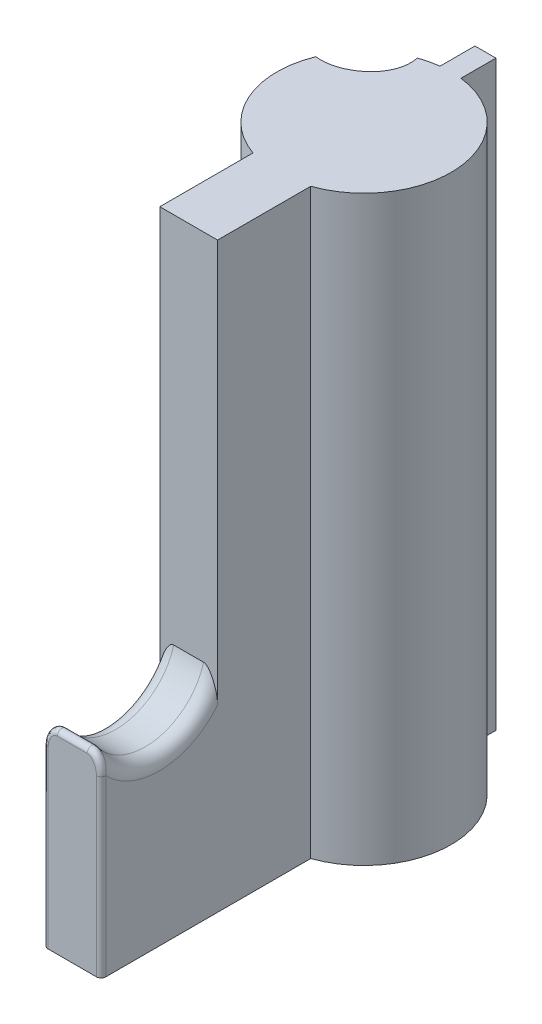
ISO-10303-21;
HEADER;
FILE_DESCRIPTION(('STEP AP214'),'2;1');
FILE_NAME('part.step','',(''),(''),'','','');
FILE_SCHEMA(('AUTOMOTIVE_DESIGN { 1 0 10303 214 1 1 1 1 }'));
ENDSEC;
DATA;
#1=APPLICATION_CONTEXT('core data for automotive mechanical design processes');
#2=APPLICATION_PROTOCOL_DEFINITION('international standard','automotive_design',2000,#1);
#3=PRODUCT_CONTEXT('',#1,'mechanical');
#4=PRODUCT('Part','Part','',(#3));
#5=PRODUCT_RELATED_PRODUCT_CATEGORY('part','',(#4));
#6=PRODUCT_DEFINITION_FORMATION('','',#4);
#7=PRODUCT_DEFINITION_CONTEXT('part definition',#1,'design');
#8=PRODUCT_DEFINITION('design','',#6,#7);
#9=PRODUCT_DEFINITION_SHAPE('','',#8);
#10=(LENGTH_UNIT() NAMED_UNIT(*) SI_UNIT(.MILLI.,.METRE.));
#11=(NAMED_UNIT(*) PLANE_ANGLE_UNIT() SI_UNIT($,.RADIAN.));
#12=(NAMED_UNIT(*) SI_UNIT($,.STERADIAN.) SOLID_ANGLE_UNIT());
#13=UNCERTAINTY_MEASURE_WITH_UNIT(LENGTH_MEASURE(1.E-05),#10,'distance_accuracy_value','');
#14=(GEOMETRIC_REPRESENTATION_CONTEXT(3) GLOBAL_UNCERTAINTY_ASSIGNED_CONTEXT((#13)) GLOBAL_UNIT_ASSIGNED_CONTEXT((#10,
#11,#12)) REPRESENTATION_CONTEXT('',''));
#15=CARTESIAN_POINT('',(0.,0.,0.));
#16=DIRECTION('',(0.,0.,1.));
#17=DIRECTION('',(1.,0.,0.));
#18=AXIS2_PLACEMENT_3D('',#15,#16,#17);
#19=CARTESIAN_POINT('',(-1.24,25.,7.52845575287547));
#20=DIRECTION('',(0.,0.,-1.));
#21=DIRECTION('',(-1.,0.,0.));
#22=AXIS2_PLACEMENT_3D('',#19,#20,#21);
#23=PLANE('',#22);
#24=DIRECTION('',(-1.,0.,0.));
#25=VECTOR('',#24,1.);
#26=CARTESIAN_POINT('',(-1.24,9.,7.52845575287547));
#27=LINE('',#26,#25);
#28=CARTESIAN_POINT('',(0.640000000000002,9.,7.52845575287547));
#29=VERTEX_POINT('',#28);
#30=CARTESIAN_POINT('',(-0.639999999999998,9.,7.52845575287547));
#31=VERTEX_POINT('',#30);
#32=EDGE_CURVE('E181',#29,#31,#27,.T.);
#33=ORIENTED_EDGE('',*,*,#32,.F.);
#34=CARTESIAN_POINT('',(0.640000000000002,9.,7.52845575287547));
#35=CARTESIAN_POINT('',(0.651747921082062,9.00005086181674,7.52845575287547));
#36=CARTESIAN_POINT('',(0.663406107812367,8.99872251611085,7.52845575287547));
#37=CARTESIAN_POINT('',(0.686013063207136,8.99384656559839,7.52845575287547));
#38=CARTESIAN_POINT('',(0.696971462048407,8.99034488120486,7.52845575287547));
#39=CARTESIAN_POINT('',(0.721526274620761,8.98023413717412,7.52845575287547));
#40=CARTESIAN_POINT('',(0.734851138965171,8.9729905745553,7.52845575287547));
#41=CARTESIAN_POINT('',(0.760340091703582,8.95653779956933,7.52845575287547));
#42=CARTESIAN_POINT('',(0.772492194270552,8.94731088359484,7.52845575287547));
#43=CARTESIAN_POINT('',(0.799275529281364,8.92461110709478,7.52845575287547));
#44=CARTESIAN_POINT('',(0.813530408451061,8.9107021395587,7.52845575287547));
#45=CARTESIAN_POINT('',(0.840678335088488,8.88159822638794,7.52845575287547));
#46=CARTESIAN_POINT('',(0.853568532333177,8.86640070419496,7.52845575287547));
#47=CARTESIAN_POINT('',(0.890744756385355,8.81946216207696,7.52845575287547));
#48=CARTESIAN_POINT('',(0.913437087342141,8.78647094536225,7.52845575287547));
#49=CARTESIAN_POINT('',(0.964825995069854,8.70469987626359,7.52845575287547));
#50=CARTESIAN_POINT('',(0.992099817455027,8.65505537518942,7.52845575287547));
#51=CARTESIAN_POINT('',(1.04245149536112,8.55360767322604,7.52845575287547));
#52=CARTESIAN_POINT('',(1.06552183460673,8.50180080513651,7.52845575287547));
#53=CARTESIAN_POINT('',(1.10769426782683,8.39674958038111,7.52845575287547));
#54=CARTESIAN_POINT('',(1.12680625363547,8.34350919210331,7.52845575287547));
#55=CARTESIAN_POINT('',(1.16101045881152,8.23581423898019,7.52845575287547));
#56=CARTESIAN_POINT('',(1.17610656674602,8.18136090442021,7.52845575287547));
#57=CARTESIAN_POINT('',(1.20509808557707,8.05792960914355,7.52845575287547));
#58=CARTESIAN_POINT('',(1.21779556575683,7.98865830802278,7.52845575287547));
#59=CARTESIAN_POINT('',(1.23087781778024,7.88408661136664,7.52845575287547));
#60=CARTESIAN_POINT('',(1.23424425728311,7.84914691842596,7.52845575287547));
#61=CARTESIAN_POINT('',(1.23880364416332,7.77910599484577,7.52845575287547));
#62=CARTESIAN_POINT('',(1.23999522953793,7.74400467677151,7.52845575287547));
#63=CARTESIAN_POINT('',(1.24,7.70888346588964,7.52845575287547));
#64=B_SPLINE_CURVE_WITH_KNOTS('',3,(#34,#35,#36,#37,#38,#39,#40,#41,#42,#43,#44,#45,#46,#47,#48,
#49,#50,#51,#52,#53,#54,#55,#56,#57,#58,#59,#60,#61,#62,#63),.UNSPECIFIED.,.F.,.F.,(4,2,2,2,2,2,
2,2,2,2,2,2,2,2,4),(0.,0.0350266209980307,0.0693372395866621,0.114576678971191,
0.160238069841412,0.219845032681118,0.279574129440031,0.399442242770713,0.569114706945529,
0.739087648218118,0.908630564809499,1.0780087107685,1.2888375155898,1.3940829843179,
1.49939434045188),.UNSPECIFIED.);
#65=CARTESIAN_POINT('',(1.24,7.70888346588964,7.52845575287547));
#66=VERTEX_POINT('',#65);
#67=EDGE_CURVE('E248',#29,#66,#64,.T.);
#68=ORIENTED_EDGE('',*,*,#67,.T.);
#69=DIRECTION('',(0.,-1.,0.));
#70=VECTOR('',#69,1.);
#71=CARTESIAN_POINT('',(1.24,25.,7.52845575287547));
#72=LINE('',#71,#70);
#73=CARTESIAN_POINT('',(1.24,25.,7.52845575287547));
#74=VERTEX_POINT('',#73);
#75=EDGE_CURVE('E231',#74,#66,#72,.T.);
#76=ORIENTED_EDGE('',*,*,#75,.F.);
#77=DIRECTION('',(1.,0.,0.));
#78=VECTOR('',#77,1.);
#79=CARTESIAN_POINT('',(-1.24,25.,7.52845575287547));
#80=LINE('',#79,#78);
#81=CARTESIAN_POINT('',(-1.24,25.,7.52845575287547));
#82=VERTEX_POINT('',#81);
#83=EDGE_CURVE('E189',#82,#74,#80,.T.);
#84=ORIENTED_EDGE('',*,*,#83,.F.);
#85=DIRECTION('',(0.,-1.,0.));
#86=VECTOR('',#85,1.);
#87=CARTESIAN_POINT('',(-1.24,25.,7.52845575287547));
#88=LINE('',#87,#86);
#89=CARTESIAN_POINT('',(-1.24,7.70888346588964,7.52845575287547));
#90=VERTEX_POINT('',#89);
#91=EDGE_CURVE('E233',#82,#90,#88,.T.);
#92=ORIENTED_EDGE('',*,*,#91,.T.);
#93=CARTESIAN_POINT('',(-1.24,7.70888346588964,7.52845575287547));
#94=CARTESIAN_POINT('',(-1.239981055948,7.75740251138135,7.52845575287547));
#95=CARTESIAN_POINT('',(-1.23771665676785,7.80587731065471,7.52845575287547));
#96=CARTESIAN_POINT('',(-1.22917593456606,7.90244211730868,7.52845575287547));
#97=CARTESIAN_POINT('',(-1.22290259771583,7.95053238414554,7.52845575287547));
#98=CARTESIAN_POINT('',(-1.2065915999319,8.04747137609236,7.52845575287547));
#99=CARTESIAN_POINT('',(-1.19645141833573,8.09630246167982,7.52845575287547));
#100=CARTESIAN_POINT('',(-1.17280474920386,8.19312979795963,7.52845575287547));
#101=CARTESIAN_POINT('',(-1.15929868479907,8.24112615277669,7.52845575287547));
#102=CARTESIAN_POINT('',(-1.12785816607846,8.34028013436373,7.52845575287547));
#103=CARTESIAN_POINT('',(-1.10964003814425,8.39134792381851,7.52845575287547));
#104=CARTESIAN_POINT('',(-1.06958843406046,8.49214989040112,7.52845575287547));
#105=CARTESIAN_POINT('',(-1.04774840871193,8.54188145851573,7.52845575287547));
#106=CARTESIAN_POINT('',(-1.00052717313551,8.63886892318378,7.52845575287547));
#107=CARTESIAN_POINT('',(-0.97519658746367,8.68614885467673,7.52845575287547));
#108=CARTESIAN_POINT('',(-0.933617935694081,8.754805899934,7.52845575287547));
#109=CARTESIAN_POINT('',(-0.919185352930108,8.7772827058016,7.52845575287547));
#110=CARTESIAN_POINT('',(-0.888811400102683,8.82118375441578,7.52845575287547));
#111=CARTESIAN_POINT('',(-0.872871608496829,8.84260906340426,7.52845575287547));
#112=CARTESIAN_POINT('',(-0.844858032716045,8.87662970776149,7.52845575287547));
#113=CARTESIAN_POINT('',(-0.833369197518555,8.88970322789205,7.52845575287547));
#114=CARTESIAN_POINT('',(-0.809232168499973,8.91486684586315,7.52845575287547));
#115=CARTESIAN_POINT('',(-0.796579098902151,8.92695236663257,7.52845575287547));
#116=CARTESIAN_POINT('',(-0.76960668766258,8.94969545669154,7.52845575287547));
#117=CARTESIAN_POINT('',(-0.755260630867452,8.96032212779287,7.52845575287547));
#118=CARTESIAN_POINT('',(-0.724874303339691,8.97860603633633,7.52845575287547));
#119=CARTESIAN_POINT('',(-0.708855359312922,8.98629594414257,7.52845575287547));
#120=CARTESIAN_POINT('',(-0.68373008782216,8.99431721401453,7.52845575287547));
#121=CARTESIAN_POINT('',(-0.675190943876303,8.99640465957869,7.52845575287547));
#122=CARTESIAN_POINT('',(-0.657779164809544,8.99926572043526,7.52845575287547));
#123=CARTESIAN_POINT('',(-0.648903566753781,9.0000209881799,7.52845575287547));
#124=CARTESIAN_POINT('',(-0.639999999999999,9.,7.52845575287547));
#125=B_SPLINE_CURVE_WITH_KNOTS('',3,(#93,#94,#95,#96,#97,#98,#99,#100,#101,#102,#103,#104,#105,
#106,#107,#108,#109,#110,#111,#112,#113,#114,#115,#116,#117,#118,#119,#120,#121,#122,#123,#124),
.UNSPECIFIED.,.F.,.F.,(4,2,2,2,2,2,2,2,2,2,2,2,2,2,2,4),(0.,0.145442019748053,0.29077582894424,
0.440265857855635,0.589737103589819,0.752257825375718,0.915075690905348,1.07574137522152,
1.15583649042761,1.23584863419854,1.28801713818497,1.34041503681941,1.39379192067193,
1.44655639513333,1.47283034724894,1.49946341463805),.UNSPECIFIED.);
#126=EDGE_CURVE('E257',#90,#31,#125,.T.);
#127=ORIENTED_EDGE('',*,*,#126,.T.);
#128=EDGE_LOOP('',(#33,#68,#76,#84,#92,#127));
#129=FACE_BOUND('',#128,.T.);
#130=ADVANCED_FACE('F33',(#129),#23,.F.);
#131=CARTESIAN_POINT('',(0.,25.,0.));
#132=DIRECTION('',(0.,-1.,0.));
#133=DIRECTION('',(0.,0.,-1.));
#134=AXIS2_PLACEMENT_3D('',#131,#132,#133);
#135=CYLINDRICAL_SURFACE('',#134,3.74);
#136=CARTESIAN_POINT('',(0.,15.,0.));
#137=DIRECTION('',(0.,-1.,0.));
#138=DIRECTION('',(0.,0.,-1.));
#139=AXIS2_PLACEMENT_3D('',#136,#137,#138);
#140=CIRCLE('',#139,3.74);
#141=CARTESIAN_POINT('',(-3.46851779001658,15.,-1.39892256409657));
#142=VERTEX_POINT('',#141);
#143=CARTESIAN_POINT('',(-1.24207433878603,15.,-3.52772608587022));
#144=VERTEX_POINT('',#143);
#145=EDGE_CURVE('E11',#142,#144,#140,.T.);
#146=ORIENTED_EDGE('',*,*,#145,.T.);
#147=DIRECTION('',(0.,1.,0.));
#148=VECTOR('',#147,1.);
#149=CARTESIAN_POINT('',(-1.24207433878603,15.,-3.52772608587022));
#150=LINE('',#149,#148);
#151=CARTESIAN_POINT('',(-1.24207433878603,25.,-3.52772608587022));
#152=VERTEX_POINT('',#151);
#153=EDGE_CURVE('E153',#144,#152,#150,.T.);
#154=ORIENTED_EDGE('',*,*,#153,.T.);
#155=CARTESIAN_POINT('',(0.,25.,0.));
#156=DIRECTION('',(0.,1.,0.));
#157=DIRECTION('',(0.,0.,1.));
#158=AXIS2_PLACEMENT_3D('',#155,#156,#157);
#159=CIRCLE('',#158,3.74);
#160=CARTESIAN_POINT('',(-0.449999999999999,25.,-3.71282910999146));
#161=VERTEX_POINT('',#160);
#162=EDGE_CURVE('E185',#161,#152,#159,.T.);
#163=ORIENTED_EDGE('',*,*,#162,.F.);
#164=DIRECTION('',(0.,-1.,0.));
#165=VECTOR('',#164,1.);
#166=CARTESIAN_POINT('',(-0.449999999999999,25.,-3.71282910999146));
#167=LINE('',#166,#165);
#168=CARTESIAN_POINT('',(-0.449999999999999,0.,-3.71282910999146));
#169=VERTEX_POINT('',#168);
#170=EDGE_CURVE('E201',#161,#169,#167,.T.);
#171=ORIENTED_EDGE('',*,*,#170,.T.);
#172=CARTESIAN_POINT('',(0.,0.,0.));
#173=DIRECTION('',(0.,1.,0.));
#174=DIRECTION('',(0.,0.,1.));
#175=AXIS2_PLACEMENT_3D('',#172,#173,#174);
#176=CIRCLE('',#175,3.74);
#177=CARTESIAN_POINT('',(-1.24,0.,3.52845575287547));
#178=VERTEX_POINT('',#177);
#179=EDGE_CURVE('E180',#169,#178,#176,.T.);
#180=ORIENTED_EDGE('',*,*,#179,.T.);
#181=DIRECTION('',(0.,-1.,0.));
#182=VECTOR('',#181,1.);
#183=CARTESIAN_POINT('',(-1.24,25.,3.52845575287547));
#184=LINE('',#183,#182);
#185=CARTESIAN_POINT('',(-1.24,25.,3.52845575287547));
#186=VERTEX_POINT('',#185);
#187=EDGE_CURVE('E236',#186,#178,#184,.T.);
#188=ORIENTED_EDGE('',*,*,#187,.F.);
#189=CARTESIAN_POINT('',(-3.46851779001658,25.,-1.39892256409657));
#190=VERTEX_POINT('',#189);
#191=EDGE_CURVE('E168',#190,#186,#159,.T.);
#192=ORIENTED_EDGE('',*,*,#191,.F.);
#193=DIRECTION('',(0.,1.,0.));
#194=VECTOR('',#193,1.);
#195=CARTESIAN_POINT('',(-3.46851779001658,15.,-1.39892256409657));
#196=LINE('',#195,#194);
#197=EDGE_CURVE('E48',#142,#190,#196,.T.);
#198=ORIENTED_EDGE('',*,*,#197,.F.);
#199=EDGE_LOOP('',(#146,#154,#163,#171,#180,#188,#192,#198));
#200=FACE_BOUND('',#199,.T.);
#201=ADVANCED_FACE('F165',(#200),#135,.T.);
#202=CARTESIAN_POINT('',(-1.24,25.,3.52845575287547));
#203=DIRECTION('',(1.,0.,0.));
#204=DIRECTION('',(0.,0.,-1.));
#205=AXIS2_PLACEMENT_3D('',#202,#203,#204);
#206=PLANE('',#205);
#207=DIRECTION('',(0.,0.,1.));
#208=VECTOR('',#207,1.);
#209=CARTESIAN_POINT('',(-1.24,0.,3.52845575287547));
#210=LINE('',#209,#208);
#211=CARTESIAN_POINT('',(-1.24,0.,12.3284557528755));
#212=VERTEX_POINT('',#211);
#213=EDGE_CURVE('E204',#178,#212,#210,.T.);
#214=ORIENTED_EDGE('',*,*,#213,.T.);
#215=DIRECTION('',(0.,-1.,0.));
#216=VECTOR('',#215,1.);
#217=CARTESIAN_POINT('',(-1.24,25.,12.3284557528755));
#218=LINE('',#217,#216);
#219=CARTESIAN_POINT('',(-1.24,7.4809064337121,12.3284557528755));
#220=VERTEX_POINT('',#219);
#221=EDGE_CURVE('E377',#212,#220,#218,.F.);
#222=ORIENTED_EDGE('',*,*,#221,.T.);
#223=CARTESIAN_POINT('',(-1.24,9.70037020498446,10.0284557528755));
#224=DIRECTION('',(1.,0.,0.));
#225=DIRECTION('',(0.,0.,-1.));
#226=AXIS2_PLACEMENT_3D('',#223,#224,#225);
#227=CIRCLE('',#226,3.19625083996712);
#228=EDGE_CURVE('E246',#220,#90,#227,.T.);
#229=ORIENTED_EDGE('',*,*,#228,.T.);
#230=ORIENTED_EDGE('',*,*,#91,.F.);
#231=DIRECTION('',(0.,0.,1.));
#232=VECTOR('',#231,1.);
#233=CARTESIAN_POINT('',(-1.24,25.,3.52845575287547));
#234=LINE('',#233,#232);
#235=EDGE_CURVE('E187',#186,#82,#234,.T.);
#236=ORIENTED_EDGE('',*,*,#235,.F.);
#237=ORIENTED_EDGE('',*,*,#187,.T.);
#238=EDGE_LOOP('',(#214,#222,#229,#230,#236,#237));
#239=FACE_BOUND('',#238,.T.);
#240=ADVANCED_FACE('F404',(#239),#206,.F.);
#241=CARTESIAN_POINT('',(1.24,25.,7.52845575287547));
#242=DIRECTION('',(-1.,0.,0.));
#243=DIRECTION('',(0.,0.,1.));
#244=AXIS2_PLACEMENT_3D('',#241,#242,#243);
#245=PLANE('',#244);
#246=CARTESIAN_POINT('',(1.24,9.70037020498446,10.0284557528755));
#247=DIRECTION('',(-1.,0.,0.));
#248=DIRECTION('',(0.,0.,1.));
#249=AXIS2_PLACEMENT_3D('',#246,#247,#248);
#250=CIRCLE('',#249,3.19625083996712);
#251=CARTESIAN_POINT('',(1.24,7.4809064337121,12.3284557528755));
#252=VERTEX_POINT('',#251);
#253=EDGE_CURVE('E239',#66,#252,#250,.T.);
#254=ORIENTED_EDGE('',*,*,#253,.T.);
#255=DIRECTION('',(0.,1.,0.));
#256=VECTOR('',#255,1.);
#257=CARTESIAN_POINT('',(1.24,25.,12.3284557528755));
#258=LINE('',#257,#256);
#259=CARTESIAN_POINT('',(1.24,0.,12.3284557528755));
#260=VERTEX_POINT('',#259);
#261=EDGE_CURVE('E369',#252,#260,#258,.F.);
#262=ORIENTED_EDGE('',*,*,#261,.T.);
#263=DIRECTION('',(0.,0.,-1.));
#264=VECTOR('',#263,1.);
#265=CARTESIAN_POINT('',(1.24,0.,7.52845575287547));
#266=LINE('',#265,#264);
#267=CARTESIAN_POINT('',(1.24,0.,3.52845575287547));
#268=VERTEX_POINT('',#267);
#269=EDGE_CURVE('E207',#260,#268,#266,.T.);
#270=ORIENTED_EDGE('',*,*,#269,.T.);
#271=DIRECTION('',(0.,-1.,0.));
#272=VECTOR('',#271,1.);
#273=CARTESIAN_POINT('',(1.24,25.,3.52845575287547));
#274=LINE('',#273,#272);
#275=CARTESIAN_POINT('',(1.24,25.,3.52845575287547));
#276=VERTEX_POINT('',#275);
#277=EDGE_CURVE('E228',#276,#268,#274,.T.);
#278=ORIENTED_EDGE('',*,*,#277,.F.);
#279=DIRECTION('',(0.,0.,-1.));
#280=VECTOR('',#279,1.);
#281=CARTESIAN_POINT('',(1.24,25.,7.52845575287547));
#282=LINE('',#281,#280);
#283=EDGE_CURVE('E191',#74,#276,#282,.T.);
#284=ORIENTED_EDGE('',*,*,#283,.F.);
#285=ORIENTED_EDGE('',*,*,#75,.T.);
#286=EDGE_LOOP('',(#254,#262,#270,#278,#284,#285));
#287=FACE_BOUND('',#286,.T.);
#288=ADVANCED_FACE('F428',(#287),#245,.F.);
#289=CARTESIAN_POINT('',(0.,25.,0.));
#290=DIRECTION('',(0.,-1.,0.));
#291=DIRECTION('',(0.,0.,-1.));
#292=AXIS2_PLACEMENT_3D('',#289,#290,#291);
#293=CYLINDRICAL_SURFACE('',#292,3.74);
#294=CARTESIAN_POINT('',(0.,0.,0.));
#295=DIRECTION('',(0.,1.,0.));
#296=DIRECTION('',(0.,0.,1.));
#297=AXIS2_PLACEMENT_3D('',#294,#295,#296);
#298=CIRCLE('',#297,3.74);
#299=CARTESIAN_POINT('',(0.450000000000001,0.,-3.71282910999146));
#300=VERTEX_POINT('',#299);
#301=EDGE_CURVE('E209',#268,#300,#298,.T.);
#302=ORIENTED_EDGE('',*,*,#301,.T.);
#303=DIRECTION('',(0.,-1.,0.));
#304=VECTOR('',#303,1.);
#305=CARTESIAN_POINT('',(0.450000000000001,25.,-3.71282910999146));
#306=LINE('',#305,#304);
#307=CARTESIAN_POINT('',(0.450000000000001,25.,-3.71282910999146));
#308=VERTEX_POINT('',#307);
#309=EDGE_CURVE('E225',#308,#300,#306,.T.);
#310=ORIENTED_EDGE('',*,*,#309,.F.);
#311=CARTESIAN_POINT('',(0.,25.,0.));
#312=DIRECTION('',(0.,1.,0.));
#313=DIRECTION('',(0.,0.,1.));
#314=AXIS2_PLACEMENT_3D('',#311,#312,#313);
#315=CIRCLE('',#314,3.74);
#316=EDGE_CURVE('E193',#276,#308,#315,.T.);
#317=ORIENTED_EDGE('',*,*,#316,.F.);
#318=ORIENTED_EDGE('',*,*,#277,.T.);
#319=EDGE_LOOP('',(#302,#310,#317,#318));
#320=FACE_BOUND('',#319,.T.);
#321=ADVANCED_FACE('F424',(#320),#293,.T.);
#322=CARTESIAN_POINT('',(0.450000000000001,25.,-5.21282910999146));
#323=DIRECTION('',(-1.,0.,0.));
#324=DIRECTION('',(0.,0.,1.));
#325=AXIS2_PLACEMENT_3D('',#322,#323,#324);
#326=PLANE('',#325);
#327=DIRECTION('',(0.,0.,-1.));
#328=VECTOR('',#327,1.);
#329=CARTESIAN_POINT('',(0.450000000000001,0.,-5.21282910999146));
#330=LINE('',#329,#328);
#331=CARTESIAN_POINT('',(0.450000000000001,0.,-5.21282910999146));
#332=VERTEX_POINT('',#331);
#333=EDGE_CURVE('E211',#300,#332,#330,.T.);
#334=ORIENTED_EDGE('',*,*,#333,.T.);
#335=DIRECTION('',(0.,-1.,0.));
#336=VECTOR('',#335,1.);
#337=CARTESIAN_POINT('',(0.450000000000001,25.,-5.21282910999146));
#338=LINE('',#337,#336);
#339=CARTESIAN_POINT('',(0.450000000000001,25.,-5.21282910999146));
#340=VERTEX_POINT('',#339);
#341=EDGE_CURVE('E222',#340,#332,#338,.T.);
#342=ORIENTED_EDGE('',*,*,#341,.F.);
#343=DIRECTION('',(0.,0.,-1.));
#344=VECTOR('',#343,1.);
#345=CARTESIAN_POINT('',(0.450000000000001,25.,-5.21282910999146));
#346=LINE('',#345,#344);
#347=EDGE_CURVE('E195',#308,#340,#346,.T.);
#348=ORIENTED_EDGE('',*,*,#347,.F.);
#349=ORIENTED_EDGE('',*,*,#309,.T.);
#350=EDGE_LOOP('',(#334,#342,#348,#349));
#351=FACE_BOUND('',#350,.T.);
#352=ADVANCED_FACE('F420',(#351),#326,.F.);
#353=CARTESIAN_POINT('',(-0.45,25.,-5.21282910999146));
#354=DIRECTION('',(0.,0.,1.));
#355=DIRECTION('',(1.,0.,0.));
#356=AXIS2_PLACEMENT_3D('',#353,#354,#355);
#357=PLANE('',#356);
#358=DIRECTION('',(-1.,0.,0.));
#359=VECTOR('',#358,1.);
#360=CARTESIAN_POINT('',(-0.45,0.,-5.21282910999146));
#361=LINE('',#360,#359);
#362=CARTESIAN_POINT('',(-0.45,0.,-5.21282910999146));
#363=VERTEX_POINT('',#362);
#364=EDGE_CURVE('E213',#332,#363,#361,.T.);
#365=ORIENTED_EDGE('',*,*,#364,.T.);
#366=DIRECTION('',(0.,-1.,0.));
#367=VECTOR('',#366,1.);
#368=CARTESIAN_POINT('',(-0.45,25.,-5.21282910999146));
#369=LINE('',#368,#367);
#370=CARTESIAN_POINT('',(-0.45,25.,-5.21282910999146));
#371=VERTEX_POINT('',#370);
#372=EDGE_CURVE('E219',#371,#363,#369,.T.);
#373=ORIENTED_EDGE('',*,*,#372,.F.);
#374=DIRECTION('',(-1.,0.,0.));
#375=VECTOR('',#374,1.);
#376=CARTESIAN_POINT('',(-0.45,25.,-5.21282910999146));
#377=LINE('',#376,#375);
#378=EDGE_CURVE('E197',#340,#371,#377,.T.);
#379=ORIENTED_EDGE('',*,*,#378,.F.);
#380=ORIENTED_EDGE('',*,*,#341,.T.);
#381=EDGE_LOOP('',(#365,#373,#379,#380));
#382=FACE_BOUND('',#381,.T.);
#383=ADVANCED_FACE('F416',(#382),#357,.F.);
#384=CARTESIAN_POINT('',(-0.45,25.,-5.21282910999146));
#385=DIRECTION('',(1.,0.,0.));
#386=DIRECTION('',(0.,0.,-1.));
#387=AXIS2_PLACEMENT_3D('',#384,#385,#386);
#388=PLANE('',#387);
#389=DIRECTION('',(0.,0.,1.));
#390=VECTOR('',#389,1.);
#391=CARTESIAN_POINT('',(-0.45,0.,-5.21282910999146));
#392=LINE('',#391,#390);
#393=EDGE_CURVE('E215',#363,#169,#392,.T.);
#394=ORIENTED_EDGE('',*,*,#393,.T.);
#395=ORIENTED_EDGE('',*,*,#170,.F.);
#396=DIRECTION('',(0.,0.,1.));
#397=VECTOR('',#396,1.);
#398=CARTESIAN_POINT('',(-0.45,25.,-5.21282910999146));
#399=LINE('',#398,#397);
#400=EDGE_CURVE('E199',#371,#161,#399,.T.);
#401=ORIENTED_EDGE('',*,*,#400,.F.);
#402=ORIENTED_EDGE('',*,*,#372,.T.);
#403=EDGE_LOOP('',(#394,#395,#401,#402));
#404=FACE_BOUND('',#403,.T.);
#405=ADVANCED_FACE('F411',(#404),#388,.F.);
#406=CARTESIAN_POINT('',(0.,25.,0.));
#407=DIRECTION('',(0.,1.,0.));
#408=DIRECTION('',(0.,0.,1.));
#409=AXIS2_PLACEMENT_3D('',#406,#407,#408);
#410=PLANE('',#409);
#411=CARTESIAN_POINT('',(-3.46851779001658,25.,-1.39892256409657));
#412=CARTESIAN_POINT('',(-2.32405578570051,25.,-1.24893989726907));
#413=CARTESIAN_POINT('',(-0.96355235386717,25.,-2.28037073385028));
#414=CARTESIAN_POINT('',(-1.24207433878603,25.,-3.52772608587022));
#415=B_SPLINE_CURVE_WITH_KNOTS('',3,(#411,#412,#413,#414),.UNSPECIFIED.,.F.,.F.,(4,4),(0.,1.),.UNSPECIFIED.);
#416=EDGE_CURVE('E157',#190,#152,#415,.T.);
#417=ORIENTED_EDGE('',*,*,#416,.F.);
#418=ORIENTED_EDGE('',*,*,#191,.T.);
#419=ORIENTED_EDGE('',*,*,#235,.T.);
#420=ORIENTED_EDGE('',*,*,#83,.T.);
#421=ORIENTED_EDGE('',*,*,#283,.T.);
#422=ORIENTED_EDGE('',*,*,#316,.T.);
#423=ORIENTED_EDGE('',*,*,#347,.T.);
#424=ORIENTED_EDGE('',*,*,#378,.T.);
#425=ORIENTED_EDGE('',*,*,#400,.T.);
#426=ORIENTED_EDGE('',*,*,#162,.T.);
#427=EDGE_LOOP('',(#417,#418,#419,#420,#421,#422,#423,#424,#425,#426));
#428=FACE_BOUND('',#427,.T.);
#429=ADVANCED_FACE('F457',(#428),#410,.T.);
#430=CARTESIAN_POINT('',(0.,0.,0.));
#431=DIRECTION('',(0.,1.,0.));
#432=DIRECTION('',(0.,0.,1.));
#433=AXIS2_PLACEMENT_3D('',#430,#431,#432);
#434=PLANE('',#433);
#435=ORIENTED_EDGE('',*,*,#269,.F.);
#436=CARTESIAN_POINT('',(1.04,0.,12.3284557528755));
#437=DIRECTION('',(0.,1.,0.));
#438=DIRECTION('',(0.,0.,1.));
#439=AXIS2_PLACEMENT_3D('',#436,#437,#438);
#440=CIRCLE('',#439,0.2);
#441=CARTESIAN_POINT('',(1.04,0.,12.5284557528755));
#442=VERTEX_POINT('',#441);
#443=EDGE_CURVE('E372',#260,#442,#440,.F.);
#444=ORIENTED_EDGE('',*,*,#443,.T.);
#445=DIRECTION('',(1.,0.,0.));
#446=VECTOR('',#445,1.);
#447=CARTESIAN_POINT('',(-1.24,0.,12.5284557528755));
#448=LINE('',#447,#446);
#449=CARTESIAN_POINT('',(-1.04,0.,12.5284557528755));
#450=VERTEX_POINT('',#449);
#451=EDGE_CURVE('E177',#450,#442,#448,.T.);
#452=ORIENTED_EDGE('',*,*,#451,.F.);
#453=CARTESIAN_POINT('',(-1.04,0.,12.3284557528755));
#454=DIRECTION('',(0.,1.,0.));
#455=DIRECTION('',(0.,0.,1.));
#456=AXIS2_PLACEMENT_3D('',#453,#454,#455);
#457=CIRCLE('',#456,0.2);
#458=EDGE_CURVE('E371',#450,#212,#457,.F.);
#459=ORIENTED_EDGE('',*,*,#458,.T.);
#460=ORIENTED_EDGE('',*,*,#213,.F.);
#461=ORIENTED_EDGE('',*,*,#179,.F.);
#462=ORIENTED_EDGE('',*,*,#393,.F.);
#463=ORIENTED_EDGE('',*,*,#364,.F.);
#464=ORIENTED_EDGE('',*,*,#333,.F.);
#465=ORIENTED_EDGE('',*,*,#301,.F.);
#466=EDGE_LOOP('',(#435,#444,#452,#459,#460,#461,#462,#463,#464,#465));
#467=FACE_BOUND('',#466,.T.);
#468=ADVANCED_FACE('F402',(#467),#434,.F.);
#469=CARTESIAN_POINT('',(0.,0.,12.5284557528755));
#470=DIRECTION('',(0.,0.,-1.));
#471=DIRECTION('',(-1.,0.,0.));
#472=AXIS2_PLACEMENT_3D('',#469,#470,#471);
#473=PLANE('',#472);
#474=ORIENTED_EDGE('',*,*,#451,.T.);
#475=DIRECTION('',(0.,1.,0.));
#476=VECTOR('',#475,1.);
#477=CARTESIAN_POINT('',(1.04,0.,12.5284557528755));
#478=LINE('',#477,#476);
#479=CARTESIAN_POINT('',(1.04,7.4809064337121,12.5284557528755));
#480=VERTEX_POINT('',#479);
#481=EDGE_CURVE('E367',#442,#480,#478,.T.);
#482=ORIENTED_EDGE('',*,*,#481,.T.);
#483=CARTESIAN_POINT('',(0.559842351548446,8.09585740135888,12.5284557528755));
#484=CARTESIAN_POINT('',(0.511165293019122,8.23201690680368,12.5284557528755));
#485=CARTESIAN_POINT('',(0.495908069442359,8.27469442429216,12.3911432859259));
#486=CARTESIAN_POINT('',(0.480650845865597,8.31737194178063,12.2538308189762));
#487=CARTESIAN_POINT('',(0.519763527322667,8.2079659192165,12.1677530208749));
#488=CARTESIAN_POINT('',(0.566273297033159,8.09815695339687,12.5284557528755));
#489=CARTESIAN_POINT('',(0.521035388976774,8.23596471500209,12.5284557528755));
#490=CARTESIAN_POINT('',(0.50696336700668,8.27882031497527,12.3906528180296));
#491=CARTESIAN_POINT('',(0.492914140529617,8.32168371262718,12.2528489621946));
#492=CARTESIAN_POINT('',(0.529409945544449,8.21053374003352,12.1671380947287));
#493=CARTESIAN_POINT('',(0.572793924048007,8.10020219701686,12.5284557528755));
#494=CARTESIAN_POINT('',(0.531195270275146,8.23952761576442,12.5284557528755));
#495=CARTESIAN_POINT('',(0.518347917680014,8.28254755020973,12.3902108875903));
#496=CARTESIAN_POINT('',(0.505518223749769,8.32557241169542,12.2519654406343));
#497=CARTESIAN_POINT('',(0.539190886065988,8.21281580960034,12.1665912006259));
#498=CARTESIAN_POINT('',(0.585985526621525,8.10374605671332,12.5284557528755));
#499=CARTESIAN_POINT('',(0.552025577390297,8.24576672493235,12.5284557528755));
#500=CARTESIAN_POINT('',(0.541668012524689,8.28907053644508,12.3894387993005));
#501=CARTESIAN_POINT('',(0.531327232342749,8.33237905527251,12.2504212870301));
#502=CARTESIAN_POINT('',(0.558978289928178,8.2167680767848,12.1656436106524));
#503=CARTESIAN_POINT('',(0.592656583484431,8.10524436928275,12.5284557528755));
#504=CARTESIAN_POINT('',(0.562692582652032,8.24843979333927,12.5284557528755));
#505=CARTESIAN_POINT('',(0.55360385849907,8.29186577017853,12.3891087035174));
#506=CARTESIAN_POINT('',(0.544527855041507,8.33529356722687,12.2497614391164));
#507=CARTESIAN_POINT('',(0.568984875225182,8.21843793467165,12.1652429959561));
#508=CARTESIAN_POINT('',(0.612773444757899,8.10884630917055,12.5284557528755));
#509=CARTESIAN_POINT('',(0.595201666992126,8.25490984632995,12.5284557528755));
#510=CARTESIAN_POINT('',(0.589935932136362,8.29862299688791,12.3883116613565));
#511=CARTESIAN_POINT('',(0.584718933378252,8.34234629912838,12.2481663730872));
#512=CARTESIAN_POINT('',(0.59916016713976,8.2224512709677,12.164279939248));
#513=CARTESIAN_POINT('',(0.626388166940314,8.11008078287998,12.5284557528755));
#514=CARTESIAN_POINT('',(0.617590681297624,8.2571815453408,12.5284557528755));
#515=CARTESIAN_POINT('',(0.614969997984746,8.30100062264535,12.3880327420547));
#516=CARTESIAN_POINT('',(0.612347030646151,8.34481975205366,12.2476097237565));
#517=CARTESIAN_POINT('',(0.619582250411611,8.22382509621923,12.1639499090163));
#518=CARTESIAN_POINT('',(0.653638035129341,8.11008184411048,12.5284557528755));
#519=CARTESIAN_POINT('',(0.662452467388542,8.2571835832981,12.5284557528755));
#520=CARTESIAN_POINT('',(0.665078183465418,8.30100280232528,12.3880324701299));
#521=CARTESIAN_POINT('',(0.667706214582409,8.34482196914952,12.2476091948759));
#522=CARTESIAN_POINT('',(0.660457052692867,8.22382626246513,12.163949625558));
#523=CARTESIAN_POINT('',(0.667273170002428,8.10884367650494,12.5284557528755));
#524=CARTESIAN_POINT('',(0.684876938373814,8.25490517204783,12.5284557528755));
#525=CARTESIAN_POINT('',(0.690152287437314,8.29861819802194,12.3883121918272));
#526=CARTESIAN_POINT('',(0.695377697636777,8.34234120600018,12.2481674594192));
#527=CARTESIAN_POINT('',(0.680909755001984,8.22244831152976,12.1642806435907));
#528=CARTESIAN_POINT('',(0.694113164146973,8.10402647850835,12.5284557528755));
#529=CARTESIAN_POINT('',(0.728221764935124,8.2462565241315,12.5284557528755));
#530=CARTESIAN_POINT('',(0.738618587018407,8.28958084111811,12.389378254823));
#531=CARTESIAN_POINT('',(0.748966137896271,8.33291367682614,12.2502997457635));
#532=CARTESIAN_POINT('',(0.721169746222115,8.21708096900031,12.1655686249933));
#533=CARTESIAN_POINT('',(0.70731800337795,8.1004473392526,12.5284557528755));
#534=CARTESIAN_POINT('',(0.749103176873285,8.23990282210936,12.5284557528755));
#535=CARTESIAN_POINT('',(0.76201070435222,8.28292789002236,12.3901646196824));
#536=CARTESIAN_POINT('',(0.77483473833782,8.32598494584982,12.2518696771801));
#537=CARTESIAN_POINT('',(0.740977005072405,8.21309145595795,12.1665256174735));
#538=CARTESIAN_POINT('',(0.7359869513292,8.09019871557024,12.5284557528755));
#539=CARTESIAN_POINT('',(0.793059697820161,8.22233513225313,12.5284557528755));
#540=CARTESIAN_POINT('',(0.811314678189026,8.26454383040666,12.3923498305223));
#541=CARTESIAN_POINT('',(0.829446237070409,8.30679749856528,12.256238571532));
#542=CARTESIAN_POINT('',(0.783980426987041,8.2016469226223,12.169266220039));
#543=CARTESIAN_POINT('',(0.751261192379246,8.08300370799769,12.5284557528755));
#544=CARTESIAN_POINT('',(0.815504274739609,8.21036321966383,12.5284557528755));
#545=CARTESIAN_POINT('',(0.836544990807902,8.25199099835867,12.3938486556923));
#546=CARTESIAN_POINT('',(0.857443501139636,8.29370550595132,12.2592311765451));
#547=CARTESIAN_POINT('',(0.806891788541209,8.19360127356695,12.1711904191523));
#548=CARTESIAN_POINT('',(0.780457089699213,8.0662433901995,12.5284557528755));
#549=CARTESIAN_POINT('',(0.856628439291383,8.18369272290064,12.5284557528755));
#550=CARTESIAN_POINT('',(0.882843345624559,8.22404288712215,12.3971909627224));
#551=CARTESIAN_POINT('',(0.908910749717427,8.26448120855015,12.2659156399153));
#552=CARTESIAN_POINT('',(0.850685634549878,8.17480230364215,12.175672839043));
#553=CARTESIAN_POINT('',(0.794375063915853,8.05667186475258,12.5284557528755));
#554=CARTESIAN_POINT('',(0.875297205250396,8.1690197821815,12.5284557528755));
#555=CARTESIAN_POINT('',(0.903900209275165,8.20864018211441,12.3990353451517));
#556=CARTESIAN_POINT('',(0.932366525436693,8.24837719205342,12.2696010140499));
#557=CARTESIAN_POINT('',(0.871562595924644,8.1640418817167,12.1782327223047));
#558=CARTESIAN_POINT('',(0.827590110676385,8.03042503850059,12.5284557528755));
#559=CARTESIAN_POINT('',(0.918085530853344,8.1303684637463,12.5284557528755));
#560=CARTESIAN_POINT('',(0.952313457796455,8.16799616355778,12.4038738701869));
#561=CARTESIAN_POINT('',(0.986231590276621,8.2058811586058,12.2792614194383));
#562=CARTESIAN_POINT('',(0.921385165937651,8.13442945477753,12.1852509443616));
#563=CARTESIAN_POINT('',(0.845990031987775,8.01262255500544,12.5284557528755));
#564=CARTESIAN_POINT('',(0.940254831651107,8.10542084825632,12.5284557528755));
#565=CARTESIAN_POINT('',(0.977370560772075,8.1417570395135,12.4069729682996));
#566=CARTESIAN_POINT('',(1.0142428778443,8.17838800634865,12.2854561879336));
#567=CARTESIAN_POINT('',(0.948985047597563,8.11425624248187,12.1900100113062));
#568=CARTESIAN_POINT('',(0.879874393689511,7.97445897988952,12.5284557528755));
#569=CARTESIAN_POINT('',(0.979308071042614,8.05410238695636,12.5284557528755));
#570=CARTESIAN_POINT('',(1.02156407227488,8.08775560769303,12.4132168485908));
#571=CARTESIAN_POINT('',(1.06357358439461,8.12171265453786,12.2979427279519));
#572=CARTESIAN_POINT('',(0.999811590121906,8.07074401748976,12.2002005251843));
#573=CARTESIAN_POINT('',(0.895352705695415,7.95409265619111,12.5284557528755));
#574=CARTESIAN_POINT('',(0.996240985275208,8.02774193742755,12.5284557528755));
#575=CARTESIAN_POINT('',(1.04068808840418,8.05999025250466,12.4163617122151));
#576=CARTESIAN_POINT('',(1.0849550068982,8.09254298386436,12.3042341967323));
#577=CARTESIAN_POINT('',(1.02302905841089,8.04739852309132,12.2056333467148));
#578=CARTESIAN_POINT('',(0.932187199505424,7.89897444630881,12.5284557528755));
#579=CARTESIAN_POINT('',(1.03503735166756,7.95853646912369,12.5284557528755));
#580=CARTESIAN_POINT('',(1.08465422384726,7.98680363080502,12.4244213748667));
#581=CARTESIAN_POINT('',(1.13381244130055,8.01582722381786,12.320303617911));
#582=CARTESIAN_POINT('',(1.07828079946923,7.98381151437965,12.2203051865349));
#583=CARTESIAN_POINT('',(0.951542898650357,7.86288757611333,12.5284557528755));
#584=CARTESIAN_POINT('',(1.05417091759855,7.91487227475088,12.5284557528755));
#585=CARTESIAN_POINT('',(1.1061036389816,7.94072895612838,12.4292730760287));
#586=CARTESIAN_POINT('',(1.1577658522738,7.96729692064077,12.3300193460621));
#587=CARTESIAN_POINT('',(1.1073143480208,7.94179749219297,12.2298816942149));
#588=CARTESIAN_POINT('',(0.984479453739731,7.78818800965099,12.5284557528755));
#589=CARTESIAN_POINT('',(1.08518774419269,7.8266479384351,12.5284557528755));
#590=CARTESIAN_POINT('',(1.14086497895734,7.84746515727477,12.4386145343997));
#591=CARTESIAN_POINT('',(1.19628114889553,7.86899709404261,12.3487015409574));
#592=CARTESIAN_POINT('',(1.15671918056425,7.85392175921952,12.2495843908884));
#593=CARTESIAN_POINT('',(0.998050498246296,7.74957114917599,12.5284557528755));
#594=CARTESIAN_POINT('',(1.09719302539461,7.78202961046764,12.5284557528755));
#595=CARTESIAN_POINT('',(1.15416309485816,7.80027428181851,12.443103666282));
#596=CARTESIAN_POINT('',(1.21099976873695,7.81916597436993,12.357692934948));
#597=CARTESIAN_POINT('',(1.17707574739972,7.80805366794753,12.2597114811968));
#598=CARTESIAN_POINT('',(1.01910722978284,7.67285068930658,12.5284557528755));
#599=CARTESIAN_POINT('',(1.11439892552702,7.69462425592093,12.5284557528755));
#600=CARTESIAN_POINT('',(1.17314205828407,7.70768789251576,12.4514875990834));
#601=CARTESIAN_POINT('',(1.23176876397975,7.72132299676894,12.3744677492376));
#602=CARTESIAN_POINT('',(1.20866084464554,7.71602477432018,12.2796580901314));
#603=CARTESIAN_POINT('',(1.02687008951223,7.63482290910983,12.5284557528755));
#604=CARTESIAN_POINT('',(1.11999755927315,7.65183917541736,12.5284557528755));
#605=CARTESIAN_POINT('',(1.17917961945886,7.66232492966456,12.4554010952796));
#606=CARTESIAN_POINT('',(1.23832767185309,7.67332758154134,12.3823037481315));
#607=CARTESIAN_POINT('',(1.22030513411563,7.67000045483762,12.2894666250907));
#608=CARTESIAN_POINT('',(1.03730909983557,7.55817362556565,12.5284557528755));
#609=CARTESIAN_POINT('',(1.12559945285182,7.56636562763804,12.5284557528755));
#610=CARTESIAN_POINT('',(1.18501652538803,7.57155212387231,12.4628887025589));
#611=CARTESIAN_POINT('',(1.24440151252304,7.57724940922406,12.3972795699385));
#612=CARTESIAN_POINT('',(1.23596364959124,7.57642248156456,12.3090379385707));
#613=CARTESIAN_POINT('',(1.03999748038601,7.51955377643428,12.5284557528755));
#614=CARTESIAN_POINT('',(1.12568167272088,7.52362830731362,12.5284557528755));
#615=CARTESIAN_POINT('',(1.18483088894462,7.5261426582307,12.4664636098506));
#616=CARTESIAN_POINT('',(1.24401530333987,7.52911439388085,12.4044371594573));
#617=CARTESIAN_POINT('',(1.23999622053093,7.52887278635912,12.3188007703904));
#618=CARTESIAN_POINT('',(1.04000275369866,7.43866856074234,12.5284557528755));
#619=CARTESIAN_POINT('',(1.11977228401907,7.43470132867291,12.5284557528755));
#620=CARTESIAN_POINT('',(1.17769506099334,7.43146753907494,12.4736077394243));
#621=CARTESIAN_POINT('',(1.23565731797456,7.42876794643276,12.4187191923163));
#622=CARTESIAN_POINT('',(1.24000413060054,7.42848376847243,12.3390077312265));
#623=CARTESIAN_POINT('',(1.03679740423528,7.39639784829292,12.5284557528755));
#624=CARTESIAN_POINT('',(1.11328056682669,7.38845152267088,12.5284557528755));
#625=CARTESIAN_POINT('',(1.17011801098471,7.38223557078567,12.4771455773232));
#626=CARTESIAN_POINT('',(1.22706352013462,7.37647329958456,12.4258034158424));
#627=CARTESIAN_POINT('',(1.23519610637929,7.37556343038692,12.3494308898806));
#628=CARTESIAN_POINT('',(1.02316361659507,7.3127935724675,12.5284557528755));
#629=CARTESIAN_POINT('',(1.09250869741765,7.29743352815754,12.5284557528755));
#630=CARTESIAN_POINT('',(1.14635180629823,7.28517170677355,12.4838338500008));
#631=CARTESIAN_POINT('',(1.20031259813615,7.27337822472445,12.4391803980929));
#632=CARTESIAN_POINT('',(1.21474542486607,7.27010190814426,12.369767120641));
#633=CARTESIAN_POINT('',(1.01268995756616,7.27146755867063,12.5284557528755));
#634=CARTESIAN_POINT('',(1.07823939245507,7.25259779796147,12.5284557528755));
#635=CARTESIAN_POINT('',(1.13010888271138,7.2373505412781,12.4869817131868));
#636=CARTESIAN_POINT('',(1.1821679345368,7.22250188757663,12.4454849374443));
#637=CARTESIAN_POINT('',(1.19903493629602,7.21756519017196,12.3796765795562));
#638=CARTESIAN_POINT('',(0.99819151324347,7.23139268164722,12.5284557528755));
#639=CARTESIAN_POINT('',(1.05956879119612,7.20906989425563,12.5284557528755));
#640=CARTESIAN_POINT('',(1.10911728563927,7.19104921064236,12.4899112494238));
#641=CARTESIAN_POINT('',(1.15866578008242,7.1730285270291,12.4513667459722));
#642=CARTESIAN_POINT('',(1.1772872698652,7.16625593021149,12.3891345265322));
#643=(BOUNDED_SURFACE() B_SPLINE_SURFACE(3,2,((#483,#484,#485,#486,#487),(#488,#489,#490,#491,
#492),(#493,#494,#495,#496,#497),(#498,#499,#500,#501,#502),(#503,#504,#505,#506,#507),(#508,
#509,#510,#511,#512),(#513,#514,#515,#516,#517),(#518,#519,#520,#521,#522),(#523,#524,#525,#526,
#527),(#528,#529,#530,#531,#532),(#533,#534,#535,#536,#537),(#538,#539,#540,#541,#542),(#543,
#544,#545,#546,#547),(#548,#549,#550,#551,#552),(#553,#554,#555,#556,#557),(#558,#559,#560,#561,
#562),(#563,#564,#565,#566,#567),(#568,#569,#570,#571,#572),(#573,#574,#575,#576,#577),(#578,
#579,#580,#581,#582),(#583,#584,#585,#586,#587),(#588,#589,#590,#591,#592),(#593,#594,#595,#596,
#597),(#598,#599,#600,#601,#602),(#603,#604,#605,#606,#607),(#608,#609,#610,#611,#612),(#613,
#614,#615,#616,#617),(#618,#619,#620,#621,#622),(#623,#624,#625,#626,#627),(#628,#629,#630,#631,
#632),(#633,#634,#635,#636,#637),(#638,#639,#640,#641,#642)),.UNSPECIFIED.,.F.,.F.,
.F.) B_SPLINE_SURFACE_WITH_KNOTS((4,2,2,2,2,2,2,2,2,2,2,2,2,2,2,4),(3,2,3),(0.,
0.0204801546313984,0.0409716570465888,0.0817490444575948,0.122604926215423,0.163462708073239,
0.213834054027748,0.264338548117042,0.340716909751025,0.417253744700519,0.539440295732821,
0.661833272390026,0.777928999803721,0.893744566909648,1.02031997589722,1.14769003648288),(0.,
0.5,1.),.UNSPECIFIED.) GEOMETRIC_REPRESENTATION_ITEM() RATIONAL_B_SPLINE_SURFACE(((1.,
0.810381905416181,1.,0.810381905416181,1.),(1.,0.809625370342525,1.,0.809625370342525,1.),(1.,
0.808942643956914,1.,0.808942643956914,1.),(1.,0.807748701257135,1.,0.807748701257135,1.),(1.,
0.807237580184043,1.,0.807237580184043,1.),(1.,0.806002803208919,1.,0.806002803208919,1.),(1.,
0.805569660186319,1.,0.805569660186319,1.),(1.,0.805569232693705,1.,0.805569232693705,1.),(1.,
0.806003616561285,1.,0.806003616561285,1.),(1.,0.807655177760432,1.,0.807655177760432,1.),(1.,
0.808872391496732,1.,0.808872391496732,1.),(1.,0.81224290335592,1.,0.81224290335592,1.),(1.,
0.814548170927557,1.,0.814548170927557,1.),(1.,0.81966129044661,1.,0.81966129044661,1.),(1.,
0.82247045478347,1.,0.82247045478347,1.),(1.,0.829797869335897,1.,0.829797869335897,1.),(1.,
0.834454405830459,1.,0.834454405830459,1.),(1.,0.843756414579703,1.,0.843756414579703,1.),(1.,
0.848401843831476,1.,0.848401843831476,1.),(1.,0.860213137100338,1.,0.860213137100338,1.),(1.,
0.867229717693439,1.,0.867229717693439,1.),(1.,0.880591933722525,1.,0.880591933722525,1.),(1.,
0.886936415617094,1.,0.886936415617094,1.),(1.,0.898672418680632,1.,0.898672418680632,1.),(1.,
0.904096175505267,1.,0.904096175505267,1.),(1.,0.914389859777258,1.,0.914389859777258,1.),(1.,
0.919261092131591,1.,0.919261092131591,1.),(1.,0.928927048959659,1.,0.928927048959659,1.),(1.,
0.933672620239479,1.,0.933672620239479,1.),(1.,0.942584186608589,1.,0.942584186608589,1.),(1.,
0.946746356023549,1.,0.946746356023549,1.),(1.,0.950599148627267,1.,0.950599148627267,1.))) REPRESENTATION_ITEM('') SURFACE());
#644=CARTESIAN_POINT('',(0.99819151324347,7.23139268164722,12.5284557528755));
#645=CARTESIAN_POINT('',(1.01268995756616,7.27146755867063,12.5284557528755));
#646=CARTESIAN_POINT('',(1.02316361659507,7.3127935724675,12.5284557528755));
#647=CARTESIAN_POINT('',(1.03679740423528,7.39639784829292,12.5284557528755));
#648=CARTESIAN_POINT('',(1.04000275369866,7.43866856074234,12.5284557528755));
#649=CARTESIAN_POINT('',(1.03999748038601,7.51955377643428,12.5284557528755));
#650=CARTESIAN_POINT('',(1.03730909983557,7.55817362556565,12.5284557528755));
#651=CARTESIAN_POINT('',(1.02687008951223,7.63482290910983,12.5284557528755));
#652=CARTESIAN_POINT('',(1.01910722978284,7.67285068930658,12.5284557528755));
#653=CARTESIAN_POINT('',(0.998050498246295,7.74957114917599,12.5284557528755));
#654=CARTESIAN_POINT('',(0.984479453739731,7.78818800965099,12.5284557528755));
#655=CARTESIAN_POINT('',(0.951542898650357,7.86288757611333,12.5284557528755));
#656=CARTESIAN_POINT('',(0.932187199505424,7.89897444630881,12.5284557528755));
#657=CARTESIAN_POINT('',(0.895352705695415,7.95409265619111,12.5284557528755));
#658=CARTESIAN_POINT('',(0.879874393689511,7.97445897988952,12.5284557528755));
#659=CARTESIAN_POINT('',(0.845990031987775,8.01262255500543,12.5284557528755));
#660=CARTESIAN_POINT('',(0.827590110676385,8.03042503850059,12.5284557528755));
#661=CARTESIAN_POINT('',(0.794375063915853,8.05667186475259,12.5284557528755));
#662=CARTESIAN_POINT('',(0.780457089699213,8.0662433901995,12.5284557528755));
#663=CARTESIAN_POINT('',(0.751261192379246,8.08300370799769,12.5284557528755));
#664=CARTESIAN_POINT('',(0.7359869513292,8.09019871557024,12.5284557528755));
#665=CARTESIAN_POINT('',(0.70731800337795,8.1004473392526,12.5284557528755));
#666=CARTESIAN_POINT('',(0.694113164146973,8.10402647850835,12.5284557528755));
#667=CARTESIAN_POINT('',(0.667273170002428,8.10884367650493,12.5284557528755));
#668=CARTESIAN_POINT('',(0.653638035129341,8.11008184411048,12.5284557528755));
#669=CARTESIAN_POINT('',(0.626388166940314,8.11008078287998,12.5284557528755));
#670=CARTESIAN_POINT('',(0.6127734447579,8.10884630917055,12.5284557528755));
#671=CARTESIAN_POINT('',(0.592656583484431,8.10524436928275,12.5284557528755));
#672=CARTESIAN_POINT('',(0.585985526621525,8.10374605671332,12.5284557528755));
#673=CARTESIAN_POINT('',(0.572793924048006,8.10020219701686,12.5284557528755));
#674=CARTESIAN_POINT('',(0.566273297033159,8.09815695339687,12.5284557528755));
#675=CARTESIAN_POINT('',(0.559842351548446,8.09585740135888,12.5284557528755));
#676=B_SPLINE_CURVE_WITH_KNOTS('',3,(#644,#645,#646,#647,#648,#649,#650,#651,#652,#653,#654,
#655,#656,#657,#658,#659,#660,#661,#662,#663,#664,#665,#666,#667,#668,#669,#670,#671,#672,#673,
#674,#675),.UNSPECIFIED.,.F.,.F.,(4,2,2,2,2,2,2,2,2,2,2,2,2,2,2,4),(0.,0.127370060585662,
0.253945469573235,0.369761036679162,0.485856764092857,0.608249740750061,0.730436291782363,
0.806973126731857,0.883351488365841,0.933855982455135,0.984227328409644,1.02508511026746,
1.06594099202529,1.10671837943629,1.12720988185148,1.14769003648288),.UNSPECIFIED.);
#677=CARTESIAN_POINT('',(0.640000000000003,8.11008131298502,12.5284557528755));
#678=VERTEX_POINT('',#677);
#679=EDGE_CURVE('E346',#480,#678,#676,.T.);
#680=ORIENTED_EDGE('',*,*,#679,.T.);
#681=DIRECTION('',(-1.,0.,0.));
#682=VECTOR('',#681,1.);
#683=CARTESIAN_POINT('',(0.,8.11008131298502,12.5284557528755));
#684=LINE('',#683,#682);
#685=CARTESIAN_POINT('',(-0.639999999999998,8.11008131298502,12.5284557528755));
#686=VERTEX_POINT('',#685);
#687=EDGE_CURVE('E348',#678,#686,#684,.T.);
#688=ORIENTED_EDGE('',*,*,#687,.T.);
#689=CARTESIAN_POINT('',(-0.998191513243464,7.23139268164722,12.5284557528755));
#690=CARTESIAN_POINT('',(-1.05956879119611,7.20906989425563,12.5284557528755));
#691=CARTESIAN_POINT('',(-1.10911728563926,7.19104921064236,12.4899112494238));
#692=CARTESIAN_POINT('',(-1.15866578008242,7.1730285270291,12.4513667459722));
#693=CARTESIAN_POINT('',(-1.1772872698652,7.16625593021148,12.3891345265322));
#694=CARTESIAN_POINT('',(-1.00977881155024,7.26332777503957,12.5284557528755));
#695=CARTESIAN_POINT('',(-1.07447429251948,7.24372193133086,12.5284557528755));
#696=CARTESIAN_POINT('',(-1.1258927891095,7.22794173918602,12.4875762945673));
#697=CARTESIAN_POINT('',(-1.17742856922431,7.21241252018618,12.4466819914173));
#698=CARTESIAN_POINT('',(-1.19466821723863,7.20713851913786,12.3815948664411));
#699=CARTESIAN_POINT('',(-1.01878484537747,7.29612327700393,12.5284557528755));
#700=CARTESIAN_POINT('',(-1.08656184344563,7.2792772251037,12.5284557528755));
#701=CARTESIAN_POINT('',(-1.13961989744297,7.2658807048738,12.4850980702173));
#702=CARTESIAN_POINT('',(-1.19276039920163,7.2527713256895,12.4417212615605));
#703=CARTESIAN_POINT('',(-1.20817726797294,7.24888975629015,12.3737556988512));
#704=CARTESIAN_POINT('',(-1.03201276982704,7.36244683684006,12.5284557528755));
#705=CARTESIAN_POINT('',(-1.10564356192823,7.35136887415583,12.5284557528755));
#706=CARTESIAN_POINT('',(-1.16137301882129,7.342789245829,12.4798917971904));
#707=CARTESIAN_POINT('',(-1.21717997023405,7.33448795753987,12.4313086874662));
#708=CARTESIAN_POINT('',(-1.22801915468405,7.33281456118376,12.3577171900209));
#709=CARTESIAN_POINT('',(-1.03626672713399,7.39596840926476,12.5284557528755));
#710=CARTESIAN_POINT('',(-1.11264343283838,7.3879377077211,12.5284557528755));
#711=CARTESIAN_POINT('',(-1.16943710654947,7.38175007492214,12.4771655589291));
#712=CARTESIAN_POINT('',(-1.22627515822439,7.37588253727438,12.4258519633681));
#713=CARTESIAN_POINT('',(-1.23440009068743,7.37498333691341,12.3495206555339));
#714=CARTESIAN_POINT('',(-1.03947003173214,7.44667552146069,12.5284557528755));
#715=CARTESIAN_POINT('',(-1.11977470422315,7.44334360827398,12.5284557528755));
#716=CARTESIAN_POINT('',(-1.17776059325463,7.4408811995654,12.4728688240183));
#717=CARTESIAN_POINT('',(-1.23575870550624,7.43850315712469,12.4172758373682));
#718=CARTESIAN_POINT('',(-1.23920504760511,7.43834893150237,12.336986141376));
#719=CARTESIAN_POINT('',(-1.0399992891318,7.46378741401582,12.5284557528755));
#720=CARTESIAN_POINT('',(-1.1215918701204,7.46212005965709,12.5284557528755));
#721=CARTESIAN_POINT('',(-1.17990789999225,7.46086940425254,12.4713893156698));
#722=CARTESIAN_POINT('',(-1.23823112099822,7.45970788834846,12.4143162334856));
#723=CARTESIAN_POINT('',(-1.23999893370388,7.45966058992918,12.3327329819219));
#724=CARTESIAN_POINT('',(-1.04000201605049,7.52945665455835,12.5284557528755));
#725=CARTESIAN_POINT('',(-1.12642047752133,7.53464080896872,12.5284557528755));
#726=CARTESIAN_POINT('',(-1.18571357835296,7.53773224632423,12.4655884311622));
#727=CARTESIAN_POINT('',(-1.24505949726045,7.54154030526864,12.4026667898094));
#728=CARTESIAN_POINT('',(-1.2400030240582,7.54116049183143,12.3163253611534));
#729=CARTESIAN_POINT('',(-1.03575286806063,7.57806419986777,12.5284557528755));
#730=CARTESIAN_POINT('',(-1.12536775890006,7.58852744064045,12.5284557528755));
#731=CARTESIAN_POINT('',(-1.18490766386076,7.59495076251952,12.4610367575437));
#732=CARTESIAN_POINT('',(-1.24436741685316,7.6022037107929,12.393547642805));
#733=CARTESIAN_POINT('',(-1.23362930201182,7.60088519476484,12.3040013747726));
#734=CARTESIAN_POINT('',(-1.0193437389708,7.67403962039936,12.5284557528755));
#735=CARTESIAN_POINT('',(-1.11474611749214,7.69604238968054,12.5284557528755));
#736=CARTESIAN_POINT('',(-1.17352506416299,7.7090634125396,12.4513987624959));
#737=CARTESIAN_POINT('',(-1.23221674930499,7.72293269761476,12.3742701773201));
#738=CARTESIAN_POINT('',(-1.2090156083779,7.71754034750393,12.2793727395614));
#739=CARTESIAN_POINT('',(-1.00716108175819,7.72140353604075,12.5284557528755));
#740=CARTESIAN_POINT('',(-1.10501496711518,7.74976587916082,12.5284557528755));
#741=CARTESIAN_POINT('',(-1.16292033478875,7.76595614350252,12.4463109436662));
#742=CARTESIAN_POINT('',(-1.22055425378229,7.78309964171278,12.3640753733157));
#743=CARTESIAN_POINT('',(-1.19074162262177,7.77446228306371,12.2670682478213));
#744=CARTESIAN_POINT('',(-0.978972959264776,7.80155519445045,12.5284557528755));
#745=CARTESIAN_POINT('',(-1.08012251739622,7.84226679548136,12.5284557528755));
#746=CARTESIAN_POINT('',(-1.13514072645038,7.86407176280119,12.4369786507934));
#747=CARTESIAN_POINT('',(-1.1900077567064,7.88641483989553,12.3454504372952));
#748=CARTESIAN_POINT('',(-1.1484594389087,7.86970508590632,12.2460691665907));
#749=CARTESIAN_POINT('',(-0.964743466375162,7.834971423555,12.5284557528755));
#750=CARTESIAN_POINT('',(-1.06685658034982,7.88154727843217,12.5284557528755));
#751=CARTESIAN_POINT('',(-1.12034152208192,7.90557903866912,12.4328515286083));
#752=CARTESIAN_POINT('',(-1.17356950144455,7.93019484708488,12.3371864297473));
#753=CARTESIAN_POINT('',(-1.12711519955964,7.90905851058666,12.2372565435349));
#754=CARTESIAN_POINT('',(-0.931545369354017,7.89932515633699,12.5284557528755));
#755=CARTESIAN_POINT('',(-1.03424911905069,7.9590793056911,12.5284557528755));
#756=CARTESIAN_POINT('',(-1.08366245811,7.98746165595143,12.4243389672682));
#757=CARTESIAN_POINT('',(-1.13281254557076,8.01642117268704,12.3201623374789));
#758=CARTESIAN_POINT('',(-1.07731805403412,7.9842036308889,12.2202133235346));
#759=CARTESIAN_POINT('',(-0.912592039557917,7.93027023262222,12.5284557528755));
#760=CARTESIAN_POINT('',(-1.01481887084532,7.99736988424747,12.5284557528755));
#761=CARTESIAN_POINT('',(-1.0618053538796,8.02784018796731,12.4199543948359));
#762=CARTESIAN_POINT('',(-1.10837976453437,8.05890879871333,12.3113856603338));
#763=CARTESIAN_POINT('',(-1.04888805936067,8.02000629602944,12.2119809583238));
#764=CARTESIAN_POINT('',(-0.878140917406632,7.97623592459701,12.5284557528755));
#765=CARTESIAN_POINT('',(-0.977266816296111,8.05651450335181,12.5284557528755));
#766=CARTESIAN_POINT('',(-1.01920476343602,8.09033734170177,12.4129184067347));
#767=CARTESIAN_POINT('',(-1.0609996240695,8.12437381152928,12.2973570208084));
#768=CARTESIAN_POINT('',(-0.997211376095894,8.07276870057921,12.1997263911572));
#769=CARTESIAN_POINT('',(-0.864413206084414,7.99258307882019,12.5284557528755));
#770=CARTESIAN_POINT('',(-0.961764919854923,8.07818859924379,12.5284557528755));
#771=CARTESIAN_POINT('',(-1.00167998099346,8.11315391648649,12.4102935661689));
#772=CARTESIAN_POINT('',(-1.041411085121,8.14832656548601,12.2921071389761));
#773=CARTESIAN_POINT('',(-0.976619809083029,8.09143491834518,12.1953620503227));
#774=CARTESIAN_POINT('',(-0.834846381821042,8.0232804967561,12.5284557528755));
#775=CARTESIAN_POINT('',(-0.926780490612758,8.1203386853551,12.5284557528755));
#776=CARTESIAN_POINT('',(-0.962096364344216,8.15748126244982,12.4051181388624));
#777=CARTESIAN_POINT('',(-0.997229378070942,8.19482727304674,12.2817568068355));
#778=CARTESIAN_POINT('',(-0.932269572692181,8.12633540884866,12.18716102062));
#779=CARTESIAN_POINT('',(-0.819008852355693,8.03763224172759,12.5284557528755));
#780=CARTESIAN_POINT('',(-0.907265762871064,8.1408019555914,12.5284557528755));
#781=CARTESIAN_POINT('',(-0.940040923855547,8.1789929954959,12.402567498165));
#782=CARTESIAN_POINT('',(-0.972595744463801,8.21736048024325,12.2766582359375));
#783=CARTESIAN_POINT('',(-0.908513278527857,8.1425714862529,12.1833239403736));
#784=CARTESIAN_POINT('',(-0.78916373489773,8.0603198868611,12.5284557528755));
#785=CARTESIAN_POINT('',(-0.868340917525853,8.1745735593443,12.5284557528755));
#786=CARTESIAN_POINT('',(-0.896047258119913,8.21447193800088,12.3983378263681));
#787=CARTESIAN_POINT('',(-0.923625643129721,8.25447446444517,12.2682074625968));
#788=CARTESIAN_POINT('',(-0.863745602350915,8.16814567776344,12.1772571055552));
#789=CARTESIAN_POINT('',(-0.775629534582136,8.06927287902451,12.5284557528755));
#790=CARTESIAN_POINT('',(-0.849985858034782,8.18842660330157,12.5284557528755));
#791=CARTESIAN_POINT('',(-0.875351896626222,8.2290105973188,12.3965965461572));
#792=CARTESIAN_POINT('',(-0.900582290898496,8.26967233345,12.2647280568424));
#793=CARTESIAN_POINT('',(-0.843444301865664,8.1782040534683,12.1748626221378));
#794=CARTESIAN_POINT('',(-0.747318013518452,8.08491663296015,12.5284557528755));
#795=CARTESIAN_POINT('',(-0.809750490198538,8.21351377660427,12.5284557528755));
#796=CARTESIAN_POINT('',(-0.830072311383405,8.25529447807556,12.3934539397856));
#797=CARTESIAN_POINT('',(-0.850262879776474,8.29715236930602,12.2584428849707));
#798=CARTESIAN_POINT('',(-0.800977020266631,8.19574170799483,12.1706788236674));
#799=CARTESIAN_POINT('',(-0.732543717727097,8.09161271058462,12.5284557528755));
#800=CARTESIAN_POINT('',(-0.787881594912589,8.224723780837,12.5284557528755));
#801=CARTESIAN_POINT('',(-0.805497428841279,8.26704624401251,12.392051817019));
#802=CARTESIAN_POINT('',(-0.823001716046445,8.30940794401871,12.2556432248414));
#803=CARTESIAN_POINT('',(-0.778815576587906,8.20322704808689,12.1688880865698));
#804=CARTESIAN_POINT('',(-0.704859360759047,8.10114290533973,12.5284557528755));
#805=CARTESIAN_POINT('',(-0.745236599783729,8.24112854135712,12.5284557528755));
#806=CARTESIAN_POINT('',(-0.757677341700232,8.2842113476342,12.3900126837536));
#807=CARTESIAN_POINT('',(-0.77004224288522,8.32732203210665,12.2515662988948));
#808=CARTESIAN_POINT('',(-0.737289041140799,8.21386702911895,12.1663396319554));
#809=CARTESIAN_POINT('',(-0.692119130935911,8.10446571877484,12.5284557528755));
#810=CARTESIAN_POINT('',(-0.725031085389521,8.24703973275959,12.5284557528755));
#811=CARTESIAN_POINT('',(-0.735046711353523,8.29039997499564,12.3892815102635));
#812=CARTESIAN_POINT('',(-0.745018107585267,8.33376764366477,12.2501063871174));
#813=CARTESIAN_POINT('',(-0.718178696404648,8.21757050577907,12.165451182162));
#814=CARTESIAN_POINT('',(-0.666253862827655,8.10893534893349,12.5284557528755));
#815=CARTESIAN_POINT('',(-0.683202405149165,8.25507494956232,12.5284557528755));
#816=CARTESIAN_POINT('',(-0.688279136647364,8.29879620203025,12.3882913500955));
#817=CARTESIAN_POINT('',(-0.693311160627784,8.34252599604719,12.2481259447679));
#818=CARTESIAN_POINT('',(-0.679380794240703,8.22255029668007,12.164256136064));
#819=CARTESIAN_POINT('',(-0.653128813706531,8.11008210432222,12.5284557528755));
#820=CARTESIAN_POINT('',(-0.661614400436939,8.25718437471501,12.5284557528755));
#821=CARTESIAN_POINT('',(-0.664142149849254,8.30100368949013,12.388032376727));
#822=CARTESIAN_POINT('',(-0.666671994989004,8.3448228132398,12.2476090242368));
#823=CARTESIAN_POINT('',(-0.659693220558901,8.22382654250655,12.1639495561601));
#824=CARTESIAN_POINT('',(-0.626388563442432,8.1100804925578,12.5284557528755));
#825=CARTESIAN_POINT('',(-0.617591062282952,8.25718068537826,12.5284557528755));
#826=CARTESIAN_POINT('',(-0.614970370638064,8.30099966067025,12.3880328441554));
#827=CARTESIAN_POINT('',(-0.612347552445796,8.34481883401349,12.247609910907));
#828=CARTESIAN_POINT('',(-0.619582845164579,8.22382478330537,12.1639499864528));
#829=CARTESIAN_POINT('',(-0.61277308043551,8.10884620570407,12.5284557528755));
#830=CARTESIAN_POINT('',(-0.595201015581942,8.25490959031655,12.5284557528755));
#831=CARTESIAN_POINT('',(-0.589935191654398,8.29862271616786,12.3883116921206));
#832=CARTESIAN_POINT('',(-0.584718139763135,8.34234602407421,12.2481664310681));
#833=CARTESIAN_POINT('',(-0.599159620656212,8.22245115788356,12.1642799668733));
#834=CARTESIAN_POINT('',(-0.592655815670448,8.10524425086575,12.5284557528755));
#835=CARTESIAN_POINT('',(-0.562691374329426,8.24843961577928,12.5284557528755));
#836=CARTESIAN_POINT('',(-0.553602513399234,8.29186559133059,12.3891087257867));
#837=CARTESIAN_POINT('',(-0.544526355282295,8.33529337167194,12.2497614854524));
#838=CARTESIAN_POINT('',(-0.568983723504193,8.21843780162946,12.1652430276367));
#839=CARTESIAN_POINT('',(-0.585984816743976,8.10374590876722,12.5284557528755));
#840=CARTESIAN_POINT('',(-0.552024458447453,8.24576647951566,12.5284557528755));
#841=CARTESIAN_POINT('',(-0.54166676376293,8.28907028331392,12.3894388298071));
#842=CARTESIAN_POINT('',(-0.531325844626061,8.3323787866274,12.250421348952));
#843=CARTESIAN_POINT('',(-0.558977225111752,8.21676791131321,12.1656436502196));
#844=CARTESIAN_POINT('',(-0.572793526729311,8.10020204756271,12.5284557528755));
#845=CARTESIAN_POINT('',(-0.531194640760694,8.23952733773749,12.5284557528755));
#846=CARTESIAN_POINT('',(-0.518347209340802,8.28254725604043,12.3902109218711));
#847=CARTESIAN_POINT('',(-0.505517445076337,8.32557210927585,12.2519655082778));
#848=CARTESIAN_POINT('',(-0.539190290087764,8.21281564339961,12.166591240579));
#849=CARTESIAN_POINT('',(-0.566273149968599,8.09815684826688,12.5284557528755));
#850=CARTESIAN_POINT('',(-0.521035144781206,8.23596449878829,12.5284557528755));
#851=CARTESIAN_POINT('',(-0.506963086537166,8.27882008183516,12.3906528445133));
#852=CARTESIAN_POINT('',(-0.492913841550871,8.32168347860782,12.2528490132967));
#853=CARTESIAN_POINT('',(-0.529409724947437,8.21053362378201,12.1671381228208));
#854=CARTESIAN_POINT('',(-0.559842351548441,8.09585740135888,12.5284557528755));
#855=CARTESIAN_POINT('',(-0.511165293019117,8.23201690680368,12.5284557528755));
#856=CARTESIAN_POINT('',(-0.495908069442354,8.27469442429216,12.3911432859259));
#857=CARTESIAN_POINT('',(-0.480650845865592,8.31737194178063,12.2538308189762));
#858=CARTESIAN_POINT('',(-0.519763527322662,8.2079659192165,12.1677530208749));
#859=(BOUNDED_SURFACE() B_SPLINE_SURFACE(3,2,((#689,#690,#691,#692,#693),(#694,#695,#696,#697,
#698),(#699,#700,#701,#702,#703),(#704,#705,#706,#707,#708),(#709,#710,#711,#712,#713),(#714,
#715,#716,#717,#718),(#719,#720,#721,#722,#723),(#724,#725,#726,#727,#728),(#729,#730,#731,#732,
#733),(#734,#735,#736,#737,#738),(#739,#740,#741,#742,#743),(#744,#745,#746,#747,#748),(#749,
#750,#751,#752,#753),(#754,#755,#756,#757,#758),(#759,#760,#761,#762,#763),(#764,#765,#766,#767,
#768),(#769,#770,#771,#772,#773),(#774,#775,#776,#777,#778),(#779,#780,#781,#782,#783),(#784,
#785,#786,#787,#788),(#789,#790,#791,#792,#793),(#794,#795,#796,#797,#798),(#799,#800,#801,#802,
#803),(#804,#805,#806,#807,#808),(#809,#810,#811,#812,#813),(#814,#815,#816,#817,#818),(#819,
#820,#821,#822,#823),(#824,#825,#826,#827,#828),(#829,#830,#831,#832,#833),(#834,#835,#836,#837,
#838),(#839,#840,#841,#842,#843),(#844,#845,#846,#847,#848),(#849,#850,#851,#852,#853),(#854,
#855,#856,#857,#858)),.UNSPECIFIED.,.F.,.F.,.F.) B_SPLINE_SURFACE_WITH_KNOTS((4,2,2,2,2,2,2,2,2,
2,2,2,2,2,2,2,4),(3,2,3),(0.,0.101717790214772,0.202744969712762,0.254087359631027,
0.399696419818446,0.545723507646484,0.654383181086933,0.762695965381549,0.826593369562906,
0.890443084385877,0.938965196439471,0.987372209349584,1.02670334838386,1.06603559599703,
1.10681371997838,1.12730515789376,1.1477846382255),(0.,0.5,1.),
.UNSPECIFIED.) GEOMETRIC_REPRESENTATION_ITEM() RATIONAL_B_SPLINE_SURFACE(((1.,0.950599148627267,
1.,0.950599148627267,1.),(1.,0.947528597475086,1.,0.947528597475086,1.),(1.,0.944255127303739,
1.,0.944255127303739,1.),(1.,0.937337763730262,1.,0.937337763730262,1.),(1.,0.933696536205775,
1.,0.933696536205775,1.),(1.,0.927920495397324,1.,0.927920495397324,1.),(1.,0.925925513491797,
1.,0.925925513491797,1.),(1.,0.918077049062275,1.,0.918077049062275,1.),(1.,0.911864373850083,
1.,0.911864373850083,1.),(1.,0.898555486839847,1.,0.898555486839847,1.),(1.,0.891456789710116,
1.,0.891456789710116,1.),(1.,0.878259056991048,1.,0.878259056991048,1.),(1.,0.872369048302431,
1.,0.872369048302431,1.),(1.,0.860084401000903,1.,0.860084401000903,1.),(1.,0.853691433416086,
1.,0.853691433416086,1.),(1.,0.843309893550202,1.,0.843309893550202,1.),(1.,0.839410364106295,
1.,0.839410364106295,1.),(1.,0.831667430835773,1.,0.831667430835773,1.),(1.,0.827823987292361,
1.,0.827823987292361,1.),(1.,0.821409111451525,1.,0.821409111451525,1.),(1.,0.818753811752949,
1.,0.818753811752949,1.),(1.,0.813941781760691,1.,0.813941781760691,1.),(1.,0.811783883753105,
1.,0.811783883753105,1.),(1.,0.808637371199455,1.,0.808637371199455,1.),(1.,0.807505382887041,
1.,0.807505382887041,1.),(1.,0.805971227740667,1.,0.805971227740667,1.),(1.,0.805569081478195,
1.,0.805569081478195,1.),(1.,0.805569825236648,1.,0.805569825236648,1.),(1.,0.806002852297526,
1.,0.806002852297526,1.),(1.,0.807237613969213,1.,0.807237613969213,1.),(1.,0.807748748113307,
1.,0.807748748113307,1.),(1.,0.808942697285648,1.,0.808942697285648,1.),(1.,0.809625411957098,
1.,0.809625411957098,1.),(1.,0.810381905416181,1.,0.810381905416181,1.))) REPRESENTATION_ITEM('') SURFACE());
#860=CARTESIAN_POINT('',(-0.559842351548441,8.09585740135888,12.5284557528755));
#861=CARTESIAN_POINT('',(-0.566273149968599,8.09815684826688,12.5284557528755));
#862=CARTESIAN_POINT('',(-0.572793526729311,8.10020204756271,12.5284557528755));
#863=CARTESIAN_POINT('',(-0.585984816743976,8.10374590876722,12.5284557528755));
#864=CARTESIAN_POINT('',(-0.592655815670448,8.10524425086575,12.5284557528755));
#865=CARTESIAN_POINT('',(-0.61277308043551,8.10884620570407,12.5284557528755));
#866=CARTESIAN_POINT('',(-0.626388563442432,8.1100804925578,12.5284557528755));
#867=CARTESIAN_POINT('',(-0.653128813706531,8.11008210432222,12.5284557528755));
#868=CARTESIAN_POINT('',(-0.666253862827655,8.10893534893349,12.5284557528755));
#869=CARTESIAN_POINT('',(-0.692119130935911,8.10446571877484,12.5284557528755));
#870=CARTESIAN_POINT('',(-0.704859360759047,8.10114290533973,12.5284557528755));
#871=CARTESIAN_POINT('',(-0.732543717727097,8.09161271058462,12.5284557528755));
#872=CARTESIAN_POINT('',(-0.747318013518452,8.08491663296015,12.5284557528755));
#873=CARTESIAN_POINT('',(-0.775629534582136,8.06927287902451,12.5284557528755));
#874=CARTESIAN_POINT('',(-0.78916373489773,8.0603198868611,12.5284557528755));
#875=CARTESIAN_POINT('',(-0.819008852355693,8.03763224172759,12.5284557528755));
#876=CARTESIAN_POINT('',(-0.834846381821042,8.0232804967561,12.5284557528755));
#877=CARTESIAN_POINT('',(-0.864413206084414,7.99258307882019,12.5284557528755));
#878=CARTESIAN_POINT('',(-0.878140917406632,7.97623592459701,12.5284557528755));
#879=CARTESIAN_POINT('',(-0.912592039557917,7.93027023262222,12.5284557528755));
#880=CARTESIAN_POINT('',(-0.931545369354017,7.89932515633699,12.5284557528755));
#881=CARTESIAN_POINT('',(-0.964743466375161,7.834971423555,12.5284557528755));
#882=CARTESIAN_POINT('',(-0.978972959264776,7.80155519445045,12.5284557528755));
#883=CARTESIAN_POINT('',(-1.00716108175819,7.72140353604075,12.5284557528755));
#884=CARTESIAN_POINT('',(-1.0193437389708,7.67403962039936,12.5284557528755));
#885=CARTESIAN_POINT('',(-1.03575286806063,7.57806419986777,12.5284557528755));
#886=CARTESIAN_POINT('',(-1.04000201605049,7.52945665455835,12.5284557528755));
#887=CARTESIAN_POINT('',(-1.0399992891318,7.46378741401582,12.5284557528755));
#888=CARTESIAN_POINT('',(-1.03947003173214,7.44667552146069,12.5284557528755));
#889=CARTESIAN_POINT('',(-1.03626672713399,7.39596840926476,12.5284557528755));
#890=CARTESIAN_POINT('',(-1.03201276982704,7.36244683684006,12.5284557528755));
#891=CARTESIAN_POINT('',(-1.01878484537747,7.29612327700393,12.5284557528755));
#892=CARTESIAN_POINT('',(-1.00977881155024,7.26332777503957,12.5284557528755));
#893=CARTESIAN_POINT('',(-0.998191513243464,7.23139268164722,12.5284557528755));
#894=B_SPLINE_CURVE_WITH_KNOTS('',3,(#860,#861,#862,#863,#864,#865,#866,#867,#868,#869,#870,
#871,#872,#873,#874,#875,#876,#877,#878,#879,#880,#881,#882,#883,#884,#885,#886,#887,#888,#889,
#890,#891,#892,#893),.UNSPECIFIED.,.F.,.F.,(4,2,2,2,2,2,2,2,2,2,2,2,2,2,2,2,4),(0.,
0.0204794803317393,0.0409709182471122,0.0817490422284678,0.121081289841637,0.160412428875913,
0.208819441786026,0.257341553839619,0.321191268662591,0.385088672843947,0.493401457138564,
0.602061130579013,0.74808821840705,0.89369727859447,0.945039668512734,1.04606684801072,
1.1477846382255),.UNSPECIFIED.);
#895=CARTESIAN_POINT('',(-1.04,7.4809064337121,12.5284557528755));
#896=VERTEX_POINT('',#895);
#897=EDGE_CURVE('E350',#686,#896,#894,.T.);
#898=ORIENTED_EDGE('',*,*,#897,.T.);
#899=DIRECTION('',(0.,-1.,0.));
#900=VECTOR('',#899,1.);
#901=CARTESIAN_POINT('',(-1.04,0.,12.5284557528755));
#902=LINE('',#901,#900);
#903=EDGE_CURVE('E351',#896,#450,#902,.T.);
#904=ORIENTED_EDGE('',*,*,#903,.T.);
#905=EDGE_LOOP('',(#474,#482,#680,#688,#898,#904));
#906=FACE_BOUND('',#905,.T.);
#907=ADVANCED_FACE('F303',(#906),#473,.F.);
#908=CARTESIAN_POINT('',(3.76,9.70037020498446,10.0284557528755));
#909=DIRECTION('',(-1.,0.,0.));
#910=DIRECTION('',(0.,0.,1.));
#911=AXIS2_PLACEMENT_3D('',#908,#909,#910);
#912=CYLINDRICAL_SURFACE('',#911,2.59625083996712);
#913=CARTESIAN_POINT('',(-0.639999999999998,9.70037020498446,10.0284557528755));
#914=DIRECTION('',(1.,0.,0.));
#915=DIRECTION('',(0.,0.,-1.));
#916=AXIS2_PLACEMENT_3D('',#913,#914,#915);
#917=CIRCLE('',#916,2.59625083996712);
#918=CARTESIAN_POINT('',(-0.639999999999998,8.22382567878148,12.1639497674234));
#919=VERTEX_POINT('',#918);
#920=EDGE_CURVE('E242',#31,#919,#917,.F.);
#921=ORIENTED_EDGE('',*,*,#920,.T.);
#922=DIRECTION('',(-1.,0.,0.));
#923=VECTOR('',#922,1.);
#924=CARTESIAN_POINT('',(3.76,8.22382567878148,12.1639497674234));
#925=LINE('',#924,#923);
#926=CARTESIAN_POINT('',(0.640000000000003,8.22382567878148,12.1639497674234));
#927=VERTEX_POINT('',#926);
#928=EDGE_CURVE('E41',#919,#927,#925,.F.);
#929=ORIENTED_EDGE('',*,*,#928,.T.);
#930=CARTESIAN_POINT('',(0.640000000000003,9.70037020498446,10.0284557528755));
#931=DIRECTION('',(-1.,0.,0.));
#932=DIRECTION('',(0.,0.,1.));
#933=AXIS2_PLACEMENT_3D('',#930,#931,#932);
#934=CIRCLE('',#933,2.59625083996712);
#935=EDGE_CURVE('E244',#927,#29,#934,.F.);
#936=ORIENTED_EDGE('',*,*,#935,.T.);
#937=ORIENTED_EDGE('',*,*,#32,.T.);
#938=EDGE_LOOP('',(#921,#929,#936,#937));
#939=FACE_BOUND('',#938,.T.);
#940=ADVANCED_FACE('F272',(#939),#912,.F.);
#941=CARTESIAN_POINT('',(0.640000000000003,9.70037020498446,10.0284557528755));
#942=DIRECTION('',(-1.,0.,0.));
#943=DIRECTION('',(0.,0.,1.));
#944=AXIS2_PLACEMENT_3D('',#941,#942,#943);
#945=TOROIDAL_SURFACE('',#944,3.19625083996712,0.6);
#946=ORIENTED_EDGE('',*,*,#935,.F.);
#947=CARTESIAN_POINT('',(0.519763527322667,8.2079659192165,12.1677530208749));
#948=CARTESIAN_POINT('',(0.529409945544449,8.21053374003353,12.1671380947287));
#949=CARTESIAN_POINT('',(0.539190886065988,8.21281580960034,12.1665912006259));
#950=CARTESIAN_POINT('',(0.558978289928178,8.2167680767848,12.1656436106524));
#951=CARTESIAN_POINT('',(0.568984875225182,8.21843793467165,12.1652429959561));
#952=CARTESIAN_POINT('',(0.59916016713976,8.2224512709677,12.164279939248));
#953=CARTESIAN_POINT('',(0.619582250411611,8.22382509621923,12.1639499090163));
#954=CARTESIAN_POINT('',(0.660457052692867,8.22382626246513,12.163949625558));
#955=CARTESIAN_POINT('',(0.680909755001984,8.22244831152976,12.1642806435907));
#956=CARTESIAN_POINT('',(0.721169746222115,8.21708096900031,12.1655686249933));
#957=CARTESIAN_POINT('',(0.740977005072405,8.21309145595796,12.1665256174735));
#958=CARTESIAN_POINT('',(0.783980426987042,8.2016469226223,12.169266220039));
#959=CARTESIAN_POINT('',(0.806891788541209,8.19360127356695,12.1711904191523));
#960=CARTESIAN_POINT('',(0.850685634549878,8.17480230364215,12.175672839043));
#961=CARTESIAN_POINT('',(0.871562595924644,8.1640418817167,12.1782327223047));
#962=CARTESIAN_POINT('',(0.921385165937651,8.13442945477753,12.1852509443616));
#963=CARTESIAN_POINT('',(0.948985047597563,8.11425624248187,12.1900100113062));
#964=CARTESIAN_POINT('',(0.999811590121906,8.07074401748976,12.2002005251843));
#965=CARTESIAN_POINT('',(1.02302905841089,8.04739852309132,12.2056333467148));
#966=CARTESIAN_POINT('',(1.07828079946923,7.98381151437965,12.2203051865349));
#967=CARTESIAN_POINT('',(1.1073143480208,7.94179749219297,12.2298816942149));
#968=CARTESIAN_POINT('',(1.15671918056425,7.85392175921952,12.2495843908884));
#969=CARTESIAN_POINT('',(1.17707574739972,7.80805366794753,12.2597114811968));
#970=CARTESIAN_POINT('',(1.20866084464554,7.71602477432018,12.2796580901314));
#971=CARTESIAN_POINT('',(1.22030513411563,7.67000045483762,12.2894666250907));
#972=CARTESIAN_POINT('',(1.23596364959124,7.57642248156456,12.3090379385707));
#973=CARTESIAN_POINT('',(1.23999622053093,7.52887278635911,12.3188007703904));
#974=CARTESIAN_POINT('',(1.24000413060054,7.42848376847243,12.3390077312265));
#975=CARTESIAN_POINT('',(1.23519610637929,7.37556343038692,12.3494308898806));
#976=CARTESIAN_POINT('',(1.21474542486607,7.27010190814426,12.3697671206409));
#977=CARTESIAN_POINT('',(1.19903493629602,7.21756519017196,12.3796765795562));
#978=CARTESIAN_POINT('',(1.1772872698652,7.16625593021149,12.3891345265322));
#979=B_SPLINE_CURVE_WITH_KNOTS('',3,(#947,#948,#949,#950,#951,#952,#953,#954,#955,#956,#957,
#958,#959,#960,#961,#962,#963,#964,#965,#966,#967,#968,#969,#970,#971,#972,#973,#974,#975,#976,
#977,#978),.UNSPECIFIED.,.F.,.F.,(4,2,2,2,2,2,2,2,2,2,2,2,2,2,2,4),(0.,0.0204801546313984,
0.0409716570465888,0.0817490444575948,0.122604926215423,0.163462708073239,0.213834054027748,
0.264338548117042,0.340716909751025,0.417253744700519,0.539440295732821,0.661833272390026,
0.777928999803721,0.893744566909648,1.02031997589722,1.14769003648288),.UNSPECIFIED.);
#980=EDGE_CURVE('E279',#927,#252,#979,.T.);
#981=ORIENTED_EDGE('',*,*,#980,.T.);
#982=ORIENTED_EDGE('',*,*,#253,.F.);
#983=ORIENTED_EDGE('',*,*,#67,.F.);
#984=EDGE_LOOP('',(#946,#981,#982,#983));
#985=FACE_BOUND('',#984,.T.);
#986=ADVANCED_FACE('F267',(#985),#945,.T.);
#987=CARTESIAN_POINT('',(-0.639999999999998,9.70037020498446,10.0284557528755));
#988=DIRECTION('',(1.,0.,0.));
#989=DIRECTION('',(0.,0.,-1.));
#990=AXIS2_PLACEMENT_3D('',#987,#988,#989);
#991=TOROIDAL_SURFACE('',#990,3.19625083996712,0.6);
#992=ORIENTED_EDGE('',*,*,#228,.F.);
#993=CARTESIAN_POINT('',(-1.1772872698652,7.16625593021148,12.3891345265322));
#994=CARTESIAN_POINT('',(-1.19466821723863,7.20713851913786,12.3815948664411));
#995=CARTESIAN_POINT('',(-1.20817726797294,7.24888975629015,12.3737556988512));
#996=CARTESIAN_POINT('',(-1.22801915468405,7.33281456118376,12.3577171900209));
#997=CARTESIAN_POINT('',(-1.23440009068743,7.37498333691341,12.3495206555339));
#998=CARTESIAN_POINT('',(-1.23920504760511,7.43834893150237,12.336986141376));
#999=CARTESIAN_POINT('',(-1.23999893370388,7.45966058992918,12.3327329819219));
#1000=CARTESIAN_POINT('',(-1.2400030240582,7.54116049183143,12.3163253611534));
#1001=CARTESIAN_POINT('',(-1.23362930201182,7.60088519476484,12.3040013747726));
#1002=CARTESIAN_POINT('',(-1.2090156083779,7.71754034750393,12.2793727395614));
#1003=CARTESIAN_POINT('',(-1.19074162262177,7.77446228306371,12.2670682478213));
#1004=CARTESIAN_POINT('',(-1.1484594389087,7.86970508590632,12.2460691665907));
#1005=CARTESIAN_POINT('',(-1.12711519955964,7.90905851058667,12.2372565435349));
#1006=CARTESIAN_POINT('',(-1.07731805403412,7.9842036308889,12.2202133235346));
#1007=CARTESIAN_POINT('',(-1.04888805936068,8.02000629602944,12.2119809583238));
#1008=CARTESIAN_POINT('',(-0.997211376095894,8.07276870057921,12.1997263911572));
#1009=CARTESIAN_POINT('',(-0.976619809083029,8.09143491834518,12.1953620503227));
#1010=CARTESIAN_POINT('',(-0.932269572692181,8.12633540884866,12.18716102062));
#1011=CARTESIAN_POINT('',(-0.908513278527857,8.1425714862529,12.1833239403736));
#1012=CARTESIAN_POINT('',(-0.863745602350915,8.16814567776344,12.1772571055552));
#1013=CARTESIAN_POINT('',(-0.843444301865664,8.1782040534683,12.1748626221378));
#1014=CARTESIAN_POINT('',(-0.800977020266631,8.19574170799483,12.1706788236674));
#1015=CARTESIAN_POINT('',(-0.778815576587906,8.20322704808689,12.1688880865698));
#1016=CARTESIAN_POINT('',(-0.737289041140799,8.21386702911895,12.1663396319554));
#1017=CARTESIAN_POINT('',(-0.718178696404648,8.21757050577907,12.165451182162));
#1018=CARTESIAN_POINT('',(-0.679380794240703,8.22255029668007,12.164256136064));
#1019=CARTESIAN_POINT('',(-0.659693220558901,8.22382654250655,12.1639495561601));
#1020=CARTESIAN_POINT('',(-0.619582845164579,8.22382478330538,12.1639499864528));
#1021=CARTESIAN_POINT('',(-0.599159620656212,8.22245115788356,12.1642799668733));
#1022=CARTESIAN_POINT('',(-0.568983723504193,8.21843780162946,12.1652430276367));
#1023=CARTESIAN_POINT('',(-0.558977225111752,8.21676791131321,12.1656436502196));
#1024=CARTESIAN_POINT('',(-0.539190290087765,8.21281564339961,12.166591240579));
#1025=CARTESIAN_POINT('',(-0.529409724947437,8.21053362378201,12.1671381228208));
#1026=CARTESIAN_POINT('',(-0.519763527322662,8.2079659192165,12.1677530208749));
#1027=B_SPLINE_CURVE_WITH_KNOTS('',3,(#993,#994,#995,#996,#997,#998,#999,#1000,#1001,#1002,
#1003,#1004,#1005,#1006,#1007,#1008,#1009,#1010,#1011,#1012,#1013,#1014,#1015,#1016,#1017,#1018,
#1019,#1020,#1021,#1022,#1023,#1024,#1025,#1026),.UNSPECIFIED.,.F.,.F.,(4,2,2,2,2,2,2,2,2,2,2,2,
2,2,2,2,4),(0.,0.101717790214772,0.202744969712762,0.254087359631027,0.399696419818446,
0.545723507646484,0.654383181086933,0.762695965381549,0.826593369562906,0.890443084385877,
0.938965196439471,0.987372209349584,1.02670334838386,1.06603559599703,1.10681371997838,
1.12730515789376,1.1477846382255),.UNSPECIFIED.);
#1028=EDGE_CURVE('E56',#220,#919,#1027,.T.);
#1029=ORIENTED_EDGE('',*,*,#1028,.T.);
#1030=ORIENTED_EDGE('',*,*,#920,.F.);
#1031=ORIENTED_EDGE('',*,*,#126,.F.);
#1032=EDGE_LOOP('',(#992,#1029,#1030,#1031));
#1033=FACE_BOUND('',#1032,.T.);
#1034=ADVANCED_FACE('F271',(#1033),#991,.T.);
#1035=CARTESIAN_POINT('',(-1.04,0.,12.3284557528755));
#1036=DIRECTION('',(0.,-1.,0.));
#1037=DIRECTION('',(0.,0.,-1.));
#1038=AXIS2_PLACEMENT_3D('',#1035,#1036,#1037);
#1039=CYLINDRICAL_SURFACE('',#1038,0.2);
#1040=ORIENTED_EDGE('',*,*,#458,.F.);
#1041=ORIENTED_EDGE('',*,*,#903,.F.);
#1042=CARTESIAN_POINT('',(-1.04,7.4809064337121,12.3284557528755));
#1043=DIRECTION('',(0.,1.,0.));
#1044=DIRECTION('',(0.,0.,1.));
#1045=AXIS2_PLACEMENT_3D('',#1042,#1043,#1044);
#1046=CIRCLE('',#1045,0.2);
#1047=EDGE_CURVE('E184',#220,#896,#1046,.T.);
#1048=ORIENTED_EDGE('',*,*,#1047,.F.);
#1049=ORIENTED_EDGE('',*,*,#221,.F.);
#1050=EDGE_LOOP('',(#1040,#1041,#1048,#1049));
#1051=FACE_BOUND('',#1050,.T.);
#1052=ADVANCED_FACE('F35',(#1051),#1039,.T.);
#1053=ORIENTED_EDGE('',*,*,#1047,.T.);
#1054=ORIENTED_EDGE('',*,*,#897,.F.);
#1055=CARTESIAN_POINT('',(-0.639999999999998,8.11008131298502,12.3284557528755));
#1056=DIRECTION('',(1.,0.,0.));
#1057=DIRECTION('',(0.,0.,-1.));
#1058=AXIS2_PLACEMENT_3D('',#1055,#1056,#1057);
#1059=CIRCLE('',#1058,0.2);
#1060=EDGE_CURVE('E314',#919,#686,#1059,.T.);
#1061=ORIENTED_EDGE('',*,*,#1060,.F.);
#1062=ORIENTED_EDGE('',*,*,#1028,.F.);
#1063=EDGE_LOOP('',(#1053,#1054,#1061,#1062));
#1064=FACE_BOUND('',#1063,.T.);
#1065=ADVANCED_FACE('F320',(#1064),#859,.T.);
#1066=CARTESIAN_POINT('',(3.76,8.11008131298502,12.3284557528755));
#1067=DIRECTION('',(-1.,0.,0.));
#1068=DIRECTION('',(0.,0.,1.));
#1069=AXIS2_PLACEMENT_3D('',#1066,#1067,#1068);
#1070=CYLINDRICAL_SURFACE('',#1069,0.2);
#1071=ORIENTED_EDGE('',*,*,#1060,.T.);
#1072=ORIENTED_EDGE('',*,*,#687,.F.);
#1073=CARTESIAN_POINT('',(0.640000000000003,8.11008131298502,12.3284557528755));
#1074=DIRECTION('',(1.,0.,0.));
#1075=DIRECTION('',(0.,0.,-1.));
#1076=AXIS2_PLACEMENT_3D('',#1073,#1074,#1075);
#1077=CIRCLE('',#1076,0.2);
#1078=EDGE_CURVE('E171',#927,#678,#1077,.T.);
#1079=ORIENTED_EDGE('',*,*,#1078,.F.);
#1080=ORIENTED_EDGE('',*,*,#928,.F.);
#1081=EDGE_LOOP('',(#1071,#1072,#1079,#1080));
#1082=FACE_BOUND('',#1081,.T.);
#1083=ADVANCED_FACE('F296',(#1082),#1070,.T.);
#1084=ORIENTED_EDGE('',*,*,#1078,.T.);
#1085=ORIENTED_EDGE('',*,*,#679,.F.);
#1086=CARTESIAN_POINT('',(1.04,7.4809064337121,12.3284557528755));
#1087=DIRECTION('',(0.,-1.,0.));
#1088=DIRECTION('',(0.,0.,-1.));
#1089=AXIS2_PLACEMENT_3D('',#1086,#1087,#1088);
#1090=CIRCLE('',#1089,0.2);
#1091=EDGE_CURVE('E169',#252,#480,#1090,.T.);
#1092=ORIENTED_EDGE('',*,*,#1091,.F.);
#1093=ORIENTED_EDGE('',*,*,#980,.F.);
#1094=EDGE_LOOP('',(#1084,#1085,#1092,#1093));
#1095=FACE_BOUND('',#1094,.T.);
#1096=ADVANCED_FACE('F288',(#1095),#643,.T.);
#1097=CARTESIAN_POINT('',(1.04,0.,12.3284557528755));
#1098=DIRECTION('',(0.,1.,0.));
#1099=DIRECTION('',(0.,0.,1.));
#1100=AXIS2_PLACEMENT_3D('',#1097,#1098,#1099);
#1101=CYLINDRICAL_SURFACE('',#1100,0.2);
#1102=ORIENTED_EDGE('',*,*,#443,.F.);
#1103=ORIENTED_EDGE('',*,*,#261,.F.);
#1104=ORIENTED_EDGE('',*,*,#1091,.T.);
#1105=ORIENTED_EDGE('',*,*,#481,.F.);
#1106=EDGE_LOOP('',(#1102,#1103,#1104,#1105));
#1107=FACE_BOUND('',#1106,.T.);
#1108=ADVANCED_FACE('F295',(#1107),#1101,.T.);
#1109=CARTESIAN_POINT('',(-1.82167706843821,15.,-1.9393225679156));
#1110=DIRECTION('',(0.,-1.,0.));
#1111=DIRECTION('',(0.,0.,-1.));
#1112=AXIS2_PLACEMENT_3D('',#1109,#1110,#1111);
#1113=PLANE('',#1112);
#1114=CARTESIAN_POINT('',(-3.46851779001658,15.,-1.39892256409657));
#1115=CARTESIAN_POINT('',(-2.32405578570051,15.,-1.24893989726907));
#1116=CARTESIAN_POINT('',(-0.96355235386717,15.,-2.28037073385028));
#1117=CARTESIAN_POINT('',(-1.24207433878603,15.,-3.52772608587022));
#1118=B_SPLINE_CURVE_WITH_KNOTS('',3,(#1114,#1115,#1116,#1117),.UNSPECIFIED.,.F.,.F.,(4,4),(0.,
1.),.UNSPECIFIED.);
#1119=EDGE_CURVE('E156',#142,#144,#1118,.T.);
#1120=ORIENTED_EDGE('',*,*,#1119,.T.);
#1121=ORIENTED_EDGE('',*,*,#145,.F.);
#1122=EDGE_LOOP('',(#1120,#1121));
#1123=FACE_BOUND('',#1122,.T.);
#1124=ADVANCED_FACE('F163',(#1123),#1113,.F.);
#1125=DIRECTION('',(0.,1.,0.));
#1126=VECTOR('',#1125,1.);
#1127=SURFACE_OF_LINEAR_EXTRUSION('',#1118,#1126);
#1128=ORIENTED_EDGE('',*,*,#416,.T.);
#1129=ORIENTED_EDGE('',*,*,#153,.F.);
#1130=ORIENTED_EDGE('',*,*,#1119,.F.);
#1131=ORIENTED_EDGE('',*,*,#197,.T.);
#1132=EDGE_LOOP('',(#1128,#1129,#1130,#1131));
#1133=FACE_BOUND('',#1132,.T.);
#1134=ADVANCED_FACE('F155',(#1133),#1127,.F.);
#1135=CLOSED_SHELL('',(#130,#201,#240,#288,#321,#352,#383,#405,#429,#468,#907,#940,#986,#1034,
#1052,#1065,#1083,#1096,#1108,#1124,#1134));
#1136=MANIFOLD_SOLID_BREP('B2',#1135);
#1137=ADVANCED_BREP_SHAPE_REPRESENTATION('',(#18,#1136),#14);
#1138=SHAPE_DEFINITION_REPRESENTATION(#9,#1137);
ENDSEC;
END-ISO-10303-21;
